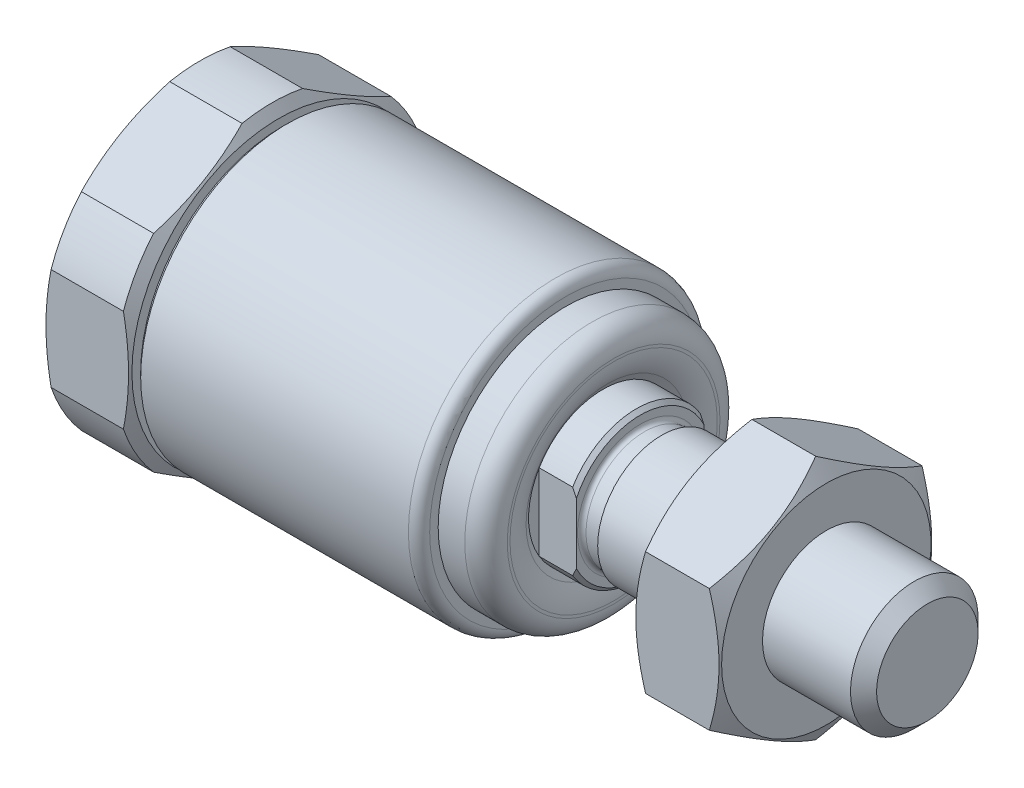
ISO-10303-21;
HEADER;
FILE_DESCRIPTION(('STEP AP214'),'2;1');
FILE_NAME('part.step','',(''),(''),'','','');
FILE_SCHEMA(('AUTOMOTIVE_DESIGN { 1 0 10303 214 1 1 1 1 }'));
ENDSEC;
DATA;
#1=APPLICATION_CONTEXT('core data for automotive mechanical design processes');
#2=APPLICATION_PROTOCOL_DEFINITION('international standard','automotive_design',2000,#1);
#3=PRODUCT_CONTEXT('',#1,'mechanical');
#4=PRODUCT('Part','Part','',(#3));
#5=PRODUCT_RELATED_PRODUCT_CATEGORY('part','',(#4));
#6=PRODUCT_DEFINITION_FORMATION('','',#4);
#7=PRODUCT_DEFINITION_CONTEXT('part definition',#1,'design');
#8=PRODUCT_DEFINITION('design','',#6,#7);
#9=PRODUCT_DEFINITION_SHAPE('','',#8);
#10=(LENGTH_UNIT() NAMED_UNIT(*) SI_UNIT(.MILLI.,.METRE.));
#11=(NAMED_UNIT(*) PLANE_ANGLE_UNIT() SI_UNIT($,.RADIAN.));
#12=(NAMED_UNIT(*) SI_UNIT($,.STERADIAN.) SOLID_ANGLE_UNIT());
#13=UNCERTAINTY_MEASURE_WITH_UNIT(LENGTH_MEASURE(1.E-05),#10,'distance_accuracy_value','');
#14=(GEOMETRIC_REPRESENTATION_CONTEXT(3) GLOBAL_UNCERTAINTY_ASSIGNED_CONTEXT((#13)) GLOBAL_UNIT_ASSIGNED_CONTEXT((#10,
#11,#12)) REPRESENTATION_CONTEXT('',''));
#15=CARTESIAN_POINT('',(0.,0.,0.));
#16=DIRECTION('',(0.,0.,1.));
#17=DIRECTION('',(1.,0.,0.));
#18=AXIS2_PLACEMENT_3D('',#15,#16,#17);
#19=CARTESIAN_POINT('',(34.5,0.,0.));
#20=DIRECTION('',(-1.,0.,0.));
#21=DIRECTION('',(0.,0.,1.));
#22=AXIS2_PLACEMENT_3D('',#19,#20,#21);
#23=CYLINDRICAL_SURFACE('',#22,7.4);
#24=CARTESIAN_POINT('',(3.7,0.,0.));
#25=DIRECTION('',(-1.,0.,0.));
#26=DIRECTION('',(0.,0.,1.));
#27=AXIS2_PLACEMENT_3D('',#24,#25,#26);
#28=CIRCLE('',#27,7.4);
#29=CARTESIAN_POINT('',(3.7,2.4,7.));
#30=VERTEX_POINT('',#29);
#31=CARTESIAN_POINT('',(3.7,4.86217782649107,5.57846096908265));
#32=VERTEX_POINT('',#31);
#33=EDGE_CURVE('E212',#30,#32,#28,.T.);
#34=ORIENTED_EDGE('',*,*,#33,.T.);
#35=DIRECTION('',(-1.,0.,0.));
#36=VECTOR('',#35,1.);
#37=CARTESIAN_POINT('',(34.5,4.86217782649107,5.57846096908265));
#38=LINE('',#37,#36);
#39=CARTESIAN_POINT('',(0.3,4.86217782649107,5.57846096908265));
#40=VERTEX_POINT('',#39);
#41=EDGE_CURVE('E544',#32,#40,#38,.T.);
#42=ORIENTED_EDGE('',*,*,#41,.T.);
#43=CARTESIAN_POINT('',(0.3,0.,0.));
#44=DIRECTION('',(-1.,0.,0.));
#45=DIRECTION('',(0.,0.,1.));
#46=AXIS2_PLACEMENT_3D('',#43,#44,#45);
#47=CIRCLE('',#46,7.4);
#48=CARTESIAN_POINT('',(0.3,2.4,7.));
#49=VERTEX_POINT('',#48);
#50=EDGE_CURVE('E222',#49,#40,#47,.T.);
#51=ORIENTED_EDGE('',*,*,#50,.F.);
#52=DIRECTION('',(-1.,0.,0.));
#53=VECTOR('',#52,1.);
#54=CARTESIAN_POINT('',(34.5,2.4,7.));
#55=LINE('',#54,#53);
#56=EDGE_CURVE('E537',#49,#30,#55,.F.);
#57=ORIENTED_EDGE('',*,*,#56,.T.);
#58=EDGE_LOOP('',(#34,#42,#51,#57));
#59=FACE_BOUND('',#58,.T.);
#60=ADVANCED_FACE('F16',(#59),#23,.T.);
#61=CARTESIAN_POINT('',(3.7,-4.86217782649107,5.57846096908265));
#62=VERTEX_POINT('',#61);
#63=CARTESIAN_POINT('',(3.7,-2.4,7.));
#64=VERTEX_POINT('',#63);
#65=EDGE_CURVE('E219',#62,#64,#28,.T.);
#66=ORIENTED_EDGE('',*,*,#65,.T.);
#67=DIRECTION('',(-1.,0.,0.));
#68=VECTOR('',#67,1.);
#69=CARTESIAN_POINT('',(34.5,-2.4,7.));
#70=LINE('',#69,#68);
#71=CARTESIAN_POINT('',(0.3,-2.4,7.));
#72=VERTEX_POINT('',#71);
#73=EDGE_CURVE('E37',#64,#72,#70,.T.);
#74=ORIENTED_EDGE('',*,*,#73,.T.);
#75=CARTESIAN_POINT('',(0.3,-4.86217782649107,5.57846096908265));
#76=VERTEX_POINT('',#75);
#77=EDGE_CURVE('E218',#76,#72,#47,.T.);
#78=ORIENTED_EDGE('',*,*,#77,.F.);
#79=DIRECTION('',(-1.,0.,0.));
#80=VECTOR('',#79,1.);
#81=CARTESIAN_POINT('',(34.5,-4.86217782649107,5.57846096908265));
#82=LINE('',#81,#80);
#83=EDGE_CURVE('E535',#76,#62,#82,.F.);
#84=ORIENTED_EDGE('',*,*,#83,.T.);
#85=EDGE_LOOP('',(#66,#74,#78,#84));
#86=FACE_BOUND('',#85,.T.);
#87=ADVANCED_FACE('F478',(#86),#23,.T.);
#88=CARTESIAN_POINT('',(3.7,-7.26217782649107,-1.42153903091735));
#89=VERTEX_POINT('',#88);
#90=CARTESIAN_POINT('',(3.7,-7.26217782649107,1.42153903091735));
#91=VERTEX_POINT('',#90);
#92=EDGE_CURVE('E214',#89,#91,#28,.T.);
#93=ORIENTED_EDGE('',*,*,#92,.T.);
#94=DIRECTION('',(-1.,0.,0.));
#95=VECTOR('',#94,1.);
#96=CARTESIAN_POINT('',(34.5,-7.26217782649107,1.42153903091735));
#97=LINE('',#96,#95);
#98=CARTESIAN_POINT('',(0.3,-7.26217782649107,1.42153903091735));
#99=VERTEX_POINT('',#98);
#100=EDGE_CURVE('E45',#91,#99,#97,.T.);
#101=ORIENTED_EDGE('',*,*,#100,.T.);
#102=CARTESIAN_POINT('',(0.3,-7.26217782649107,-1.42153903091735));
#103=VERTEX_POINT('',#102);
#104=EDGE_CURVE('E523',#103,#99,#47,.T.);
#105=ORIENTED_EDGE('',*,*,#104,.F.);
#106=DIRECTION('',(-1.,0.,0.));
#107=VECTOR('',#106,1.);
#108=CARTESIAN_POINT('',(34.5,-7.26217782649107,-1.42153903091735));
#109=LINE('',#108,#107);
#110=EDGE_CURVE('E519',#103,#89,#109,.F.);
#111=ORIENTED_EDGE('',*,*,#110,.T.);
#112=EDGE_LOOP('',(#93,#101,#105,#111));
#113=FACE_BOUND('',#112,.T.);
#114=ADVANCED_FACE('F484',(#113),#23,.T.);
#115=CARTESIAN_POINT('',(3.7000000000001,-2.40000000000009,-7.));
#116=VERTEX_POINT('',#115);
#117=CARTESIAN_POINT('',(3.7,-4.86217782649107,-5.57846096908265));
#118=VERTEX_POINT('',#117);
#119=EDGE_CURVE('E210',#116,#118,#28,.T.);
#120=ORIENTED_EDGE('',*,*,#119,.T.);
#121=DIRECTION('',(-1.,0.,0.));
#122=VECTOR('',#121,1.);
#123=CARTESIAN_POINT('',(34.5,-4.86217782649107,-5.57846096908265));
#124=LINE('',#123,#122);
#125=CARTESIAN_POINT('',(0.3,-4.86217782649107,-5.57846096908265));
#126=VERTEX_POINT('',#125);
#127=EDGE_CURVE('E514',#118,#126,#124,.T.);
#128=ORIENTED_EDGE('',*,*,#127,.T.);
#129=CARTESIAN_POINT('',(0.3,-2.4,-7.));
#130=VERTEX_POINT('',#129);
#131=EDGE_CURVE('E528',#130,#126,#47,.T.);
#132=ORIENTED_EDGE('',*,*,#131,.F.);
#133=DIRECTION('',(-1.,0.,0.));
#134=VECTOR('',#133,1.);
#135=CARTESIAN_POINT('',(34.5,-2.4,-7.));
#136=LINE('',#135,#134);
#137=EDGE_CURVE('E391',#130,#116,#136,.F.);
#138=ORIENTED_EDGE('',*,*,#137,.T.);
#139=EDGE_LOOP('',(#120,#128,#132,#138));
#140=FACE_BOUND('',#139,.T.);
#141=ADVANCED_FACE('F496',(#140),#23,.T.);
#142=CARTESIAN_POINT('',(3.7,4.86217782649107,-5.57846096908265));
#143=VERTEX_POINT('',#142);
#144=CARTESIAN_POINT('',(3.7,2.4,-7.));
#145=VERTEX_POINT('',#144);
#146=EDGE_CURVE('E201',#143,#145,#28,.T.);
#147=ORIENTED_EDGE('',*,*,#146,.T.);
#148=DIRECTION('',(-1.,0.,0.));
#149=VECTOR('',#148,1.);
#150=CARTESIAN_POINT('',(34.5,2.4,-7.));
#151=LINE('',#150,#149);
#152=CARTESIAN_POINT('',(0.3,2.4,-7.));
#153=VERTEX_POINT('',#152);
#154=EDGE_CURVE('E525',#145,#153,#151,.T.);
#155=ORIENTED_EDGE('',*,*,#154,.T.);
#156=CARTESIAN_POINT('',(0.3,4.86217782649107,-5.57846096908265));
#157=VERTEX_POINT('',#156);
#158=EDGE_CURVE('E203',#157,#153,#47,.T.);
#159=ORIENTED_EDGE('',*,*,#158,.F.);
#160=DIRECTION('',(-1.,0.,0.));
#161=VECTOR('',#160,1.);
#162=CARTESIAN_POINT('',(34.5,4.86217782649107,-5.57846096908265));
#163=LINE('',#162,#161);
#164=EDGE_CURVE('E185',#157,#143,#163,.F.);
#165=ORIENTED_EDGE('',*,*,#164,.T.);
#166=EDGE_LOOP('',(#147,#155,#159,#165));
#167=FACE_BOUND('',#166,.T.);
#168=ADVANCED_FACE('F199',(#167),#23,.T.);
#169=CARTESIAN_POINT('',(34.5,0.,0.));
#170=DIRECTION('',(-1.,0.,0.));
#171=DIRECTION('',(0.,0.,1.));
#172=AXIS2_PLACEMENT_3D('',#169,#170,#171);
#173=CYLINDRICAL_SURFACE('',#172,3.5);
#174=CARTESIAN_POINT('',(19.25,0.,0.));
#175=DIRECTION('',(-1.,0.,0.));
#176=DIRECTION('',(0.,0.,1.));
#177=AXIS2_PLACEMENT_3D('',#174,#175,#176);
#178=CIRCLE('',#177,3.5);
#179=CARTESIAN_POINT('',(19.25,1.802775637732,3.));
#180=VERTEX_POINT('',#179);
#181=CARTESIAN_POINT('',(19.25,1.802775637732,-3.));
#182=VERTEX_POINT('',#181);
#183=EDGE_CURVE('E552',#180,#182,#178,.T.);
#184=ORIENTED_EDGE('',*,*,#183,.F.);
#185=DIRECTION('',(1.,0.,0.));
#186=VECTOR('',#185,1.);
#187=CARTESIAN_POINT('',(19.25,1.802775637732,3.));
#188=LINE('',#187,#186);
#189=CARTESIAN_POINT('',(20.8232233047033,1.802775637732,3.));
#190=VERTEX_POINT('',#189);
#191=EDGE_CURVE('E576',#180,#190,#188,.T.);
#192=ORIENTED_EDGE('',*,*,#191,.T.);
#193=CARTESIAN_POINT('',(20.8232233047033,0.,0.));
#194=DIRECTION('',(-1.,0.,0.));
#195=DIRECTION('',(0.,0.,1.));
#196=AXIS2_PLACEMENT_3D('',#193,#194,#195);
#197=CIRCLE('',#196,3.5);
#198=CARTESIAN_POINT('',(20.8232233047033,1.802775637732,-3.));
#199=VERTEX_POINT('',#198);
#200=EDGE_CURVE('E650',#190,#199,#197,.T.);
#201=ORIENTED_EDGE('',*,*,#200,.T.);
#202=DIRECTION('',(1.,0.,0.));
#203=VECTOR('',#202,1.);
#204=CARTESIAN_POINT('',(19.25,1.802775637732,-3.));
#205=LINE('',#204,#203);
#206=EDGE_CURVE('E579',#182,#199,#205,.T.);
#207=ORIENTED_EDGE('',*,*,#206,.F.);
#208=EDGE_LOOP('',(#184,#192,#201,#207));
#209=FACE_BOUND('',#208,.T.);
#210=ADVANCED_FACE('F495',(#209),#173,.T.);
#211=CARTESIAN_POINT('',(19.25,-1.802775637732,-3.));
#212=VERTEX_POINT('',#211);
#213=CARTESIAN_POINT('',(19.25,-1.802775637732,3.));
#214=VERTEX_POINT('',#213);
#215=EDGE_CURVE('E546',#212,#214,#178,.T.);
#216=ORIENTED_EDGE('',*,*,#215,.F.);
#217=DIRECTION('',(1.,0.,0.));
#218=VECTOR('',#217,1.);
#219=CARTESIAN_POINT('',(19.25,-1.802775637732,-3.));
#220=LINE('',#219,#218);
#221=CARTESIAN_POINT('',(20.8232233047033,-1.802775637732,-3.));
#222=VERTEX_POINT('',#221);
#223=EDGE_CURVE('E572',#212,#222,#220,.T.);
#224=ORIENTED_EDGE('',*,*,#223,.T.);
#225=CARTESIAN_POINT('',(20.8232233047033,-1.802775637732,3.));
#226=VERTEX_POINT('',#225);
#227=EDGE_CURVE('E654',#222,#226,#197,.T.);
#228=ORIENTED_EDGE('',*,*,#227,.T.);
#229=DIRECTION('',(1.,0.,0.));
#230=VECTOR('',#229,1.);
#231=CARTESIAN_POINT('',(19.25,-1.802775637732,3.));
#232=LINE('',#231,#230);
#233=EDGE_CURVE('E573',#214,#226,#232,.T.);
#234=ORIENTED_EDGE('',*,*,#233,.F.);
#235=EDGE_LOOP('',(#216,#224,#228,#234));
#236=FACE_BOUND('',#235,.T.);
#237=ADVANCED_FACE('F502',(#236),#173,.T.);
#238=CARTESIAN_POINT('',(21.,0.,0.));
#239=DIRECTION('',(-1.,0.,0.));
#240=DIRECTION('',(0.,0.,1.));
#241=AXIS2_PLACEMENT_3D('',#238,#239,#240);
#242=CONICAL_SURFACE('',#241,3.32322330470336,0.785398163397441);
#243=CARTESIAN_POINT('',(19.3480643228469,-3.96890499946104,3.));
#244=CARTESIAN_POINT('',(19.4155355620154,-3.88431474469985,3.));
#245=CARTESIAN_POINT('',(19.4825414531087,-3.79934913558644,3.));
#246=CARTESIAN_POINT('',(19.6154309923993,-3.62852800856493,3.));
#247=CARTESIAN_POINT('',(19.6813144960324,-3.54267237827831,3.));
#248=CARTESIAN_POINT('',(19.8119932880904,-3.36963189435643,3.));
#249=CARTESIAN_POINT('',(19.8767836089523,-3.28244328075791,3.));
#250=CARTESIAN_POINT('',(20.0047535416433,-3.10689454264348,3.));
#251=CARTESIAN_POINT('',(20.0679332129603,-3.01853446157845,3.));
#252=CARTESIAN_POINT('',(20.1947038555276,-2.83708406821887,3.));
#253=CARTESIAN_POINT('',(20.2582199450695,-2.74394127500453,3.));
#254=CARTESIAN_POINT('',(20.3826749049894,-2.55595107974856,3.));
#255=CARTESIAN_POINT('',(20.4436139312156,-2.46110378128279,3.));
#256=CARTESIAN_POINT('',(20.5622107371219,-2.26955195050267,3.));
#257=CARTESIAN_POINT('',(20.6198729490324,-2.17285017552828,3.));
#258=CARTESIAN_POINT('',(20.7311858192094,-1.97717196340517,3.));
#259=CARTESIAN_POINT('',(20.7848372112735,-1.87819594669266,3.));
#260=CARTESIAN_POINT('',(20.8834935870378,-1.68468733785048,3.));
#261=CARTESIAN_POINT('',(20.9288411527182,-1.59033057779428,3.));
#262=CARTESIAN_POINT('',(21.0140986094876,-1.39915166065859,3.));
#263=CARTESIAN_POINT('',(21.0540077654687,-1.30232917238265,3.));
#264=CARTESIAN_POINT('',(21.1268071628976,-1.10690174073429,3.));
#265=CARTESIAN_POINT('',(21.1597491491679,-1.00831629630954,3.));
#266=CARTESIAN_POINT('',(21.2175687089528,-0.80881752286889,3.));
#267=CARTESIAN_POINT('',(21.2424501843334,-0.707905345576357,3.));
#268=CARTESIAN_POINT('',(21.2797282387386,-0.519649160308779,3.));
#269=CARTESIAN_POINT('',(21.2934459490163,-0.432568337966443,3.));
#270=CARTESIAN_POINT('',(21.3134419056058,-0.25755480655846,3.));
#271=CARTESIAN_POINT('',(21.3197212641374,-0.169622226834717,3.));
#272=CARTESIAN_POINT('',(21.3245048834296,0.00637237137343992,3.));
#273=CARTESIAN_POINT('',(21.3230166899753,0.0944341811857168,3.));
#274=CARTESIAN_POINT('',(21.3123667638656,0.270093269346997,3.));
#275=CARTESIAN_POINT('',(21.3032039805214,0.357690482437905,3.));
#276=CARTESIAN_POINT('',(21.2743507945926,0.554418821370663,3.));
#277=CARTESIAN_POINT('',(21.2525457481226,0.663240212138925,3.));
#278=CARTESIAN_POINT('',(21.1990102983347,0.87840472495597,3.));
#279=CARTESIAN_POINT('',(21.1672754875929,0.984746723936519,3.));
#280=CARTESIAN_POINT('',(21.0952210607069,1.1958082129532,3.));
#281=CARTESIAN_POINT('',(21.0548068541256,1.30049494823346,3.));
#282=CARTESIAN_POINT('',(20.9672963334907,1.5069818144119,3.));
#283=CARTESIAN_POINT('',(20.9202010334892,1.60878238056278,3.));
#284=CARTESIAN_POINT('',(20.8188213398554,1.81357364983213,3.));
#285=CARTESIAN_POINT('',(20.7643312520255,1.91646164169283,3.));
#286=CARTESIAN_POINT('',(20.6508647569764,2.11974762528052,3.));
#287=CARTESIAN_POINT('',(20.5918872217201,2.22014498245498,3.));
#288=CARTESIAN_POINT('',(20.4703034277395,2.41892156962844,3.));
#289=CARTESIAN_POINT('',(20.4076916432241,2.51729740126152,3.));
#290=CARTESIAN_POINT('',(20.2796375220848,2.71219114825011,3.));
#291=CARTESIAN_POINT('',(20.2141949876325,2.8087089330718,3.));
#292=CARTESIAN_POINT('',(20.0841152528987,2.99571965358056,3.));
#293=CARTESIAN_POINT('',(20.0195811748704,3.08628456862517,3.));
#294=CARTESIAN_POINT('',(19.8888029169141,3.26617452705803,3.));
#295=CARTESIAN_POINT('',(19.8225586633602,3.35549951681,3.));
#296=CARTESIAN_POINT('',(19.6889383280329,3.53270086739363,3.));
#297=CARTESIAN_POINT('',(19.6215682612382,3.62058177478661,3.));
#298=CARTESIAN_POINT('',(19.485648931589,3.79540756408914,3.));
#299=CARTESIAN_POINT('',(19.4170998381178,3.88235257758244,3.));
#300=CARTESIAN_POINT('',(19.3480643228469,3.96890499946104,3.));
#301=B_SPLINE_CURVE_WITH_KNOTS('',3,(#243,#244,#245,#246,#247,#248,#249,#250,#251,#252,#253,
#254,#255,#256,#257,#258,#259,#260,#261,#262,#263,#264,#265,#266,#267,#268,#269,#270,#271,#272,
#273,#274,#275,#276,#277,#278,#279,#280,#281,#282,#283,#284,#285,#286,#287,#288,#289,#290,#291,
#292,#293,#294,#295,#296,#297,#298,#299,#300),.UNSPECIFIED.,.F.,.F.,(4,2,2,2,2,2,2,2,2,2,2,2,2,
2,2,2,2,2,2,2,2,2,2,2,2,2,2,2,4),(0.,0.324612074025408,0.649265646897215,0.975128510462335,
1.30097932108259,1.63915887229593,1.97731794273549,2.31500816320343,2.65263644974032,
2.96656313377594,3.28053220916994,3.59208051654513,3.90347778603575,4.16765077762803,
4.43178426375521,4.69566120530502,4.95957427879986,5.29196140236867,5.62449626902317,
5.96085791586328,6.2971685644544,6.64630701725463,6.99553352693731,7.34530569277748,
7.69510234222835,8.0286953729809,8.36230278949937,8.69449076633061,9.02663141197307),.UNSPECIFIED.);
#302=CARTESIAN_POINT('',(21.,-1.42961992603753,3.));
#303=VERTEX_POINT('',#302);
#304=EDGE_CURVE('E1273',#226,#303,#301,.T.);
#305=ORIENTED_EDGE('',*,*,#304,.F.);
#306=ORIENTED_EDGE('',*,*,#227,.F.);
#307=CARTESIAN_POINT('',(19.3480643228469,3.96890499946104,-3.));
#308=CARTESIAN_POINT('',(19.4155355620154,3.88431474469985,-3.));
#309=CARTESIAN_POINT('',(19.4825414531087,3.79934913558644,-3.));
#310=CARTESIAN_POINT('',(19.6154309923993,3.62852800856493,-3.));
#311=CARTESIAN_POINT('',(19.6813144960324,3.54267237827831,-3.));
#312=CARTESIAN_POINT('',(19.8119932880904,3.36963189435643,-3.));
#313=CARTESIAN_POINT('',(19.8767836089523,3.28244328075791,-3.));
#314=CARTESIAN_POINT('',(20.0047535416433,3.10689454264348,-3.));
#315=CARTESIAN_POINT('',(20.0679332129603,3.01853446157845,-3.));
#316=CARTESIAN_POINT('',(20.1947038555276,2.83708406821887,-3.));
#317=CARTESIAN_POINT('',(20.2582199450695,2.74394127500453,-3.));
#318=CARTESIAN_POINT('',(20.3826749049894,2.55595107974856,-3.));
#319=CARTESIAN_POINT('',(20.4436139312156,2.46110378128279,-3.));
#320=CARTESIAN_POINT('',(20.5622107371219,2.26955195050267,-3.));
#321=CARTESIAN_POINT('',(20.6198729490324,2.17285017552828,-3.));
#322=CARTESIAN_POINT('',(20.7311858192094,1.97717196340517,-3.));
#323=CARTESIAN_POINT('',(20.7848372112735,1.87819594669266,-3.));
#324=CARTESIAN_POINT('',(20.8834935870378,1.68468733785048,-3.));
#325=CARTESIAN_POINT('',(20.9288411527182,1.59033057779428,-3.));
#326=CARTESIAN_POINT('',(21.0140986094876,1.39915166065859,-3.));
#327=CARTESIAN_POINT('',(21.0540077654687,1.30232917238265,-3.));
#328=CARTESIAN_POINT('',(21.1268071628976,1.10690174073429,-3.));
#329=CARTESIAN_POINT('',(21.1597491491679,1.00831629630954,-3.));
#330=CARTESIAN_POINT('',(21.2175687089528,0.80881752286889,-3.));
#331=CARTESIAN_POINT('',(21.2424501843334,0.707905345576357,-3.));
#332=CARTESIAN_POINT('',(21.2797282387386,0.519649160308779,-3.));
#333=CARTESIAN_POINT('',(21.2934459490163,0.432568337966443,-3.));
#334=CARTESIAN_POINT('',(21.3134419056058,0.25755480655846,-3.));
#335=CARTESIAN_POINT('',(21.3197212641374,0.169622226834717,-3.));
#336=CARTESIAN_POINT('',(21.3245048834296,-0.00637237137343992,-3.));
#337=CARTESIAN_POINT('',(21.3230166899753,-0.0944341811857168,-3.));
#338=CARTESIAN_POINT('',(21.3123667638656,-0.270093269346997,-3.));
#339=CARTESIAN_POINT('',(21.3032039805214,-0.357690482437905,-3.));
#340=CARTESIAN_POINT('',(21.2743507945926,-0.554418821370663,-3.));
#341=CARTESIAN_POINT('',(21.2525457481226,-0.663240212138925,-3.));
#342=CARTESIAN_POINT('',(21.1990102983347,-0.87840472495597,-3.));
#343=CARTESIAN_POINT('',(21.1672754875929,-0.984746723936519,-3.));
#344=CARTESIAN_POINT('',(21.0952210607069,-1.1958082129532,-3.));
#345=CARTESIAN_POINT('',(21.0548068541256,-1.30049494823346,-3.));
#346=CARTESIAN_POINT('',(20.9672963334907,-1.5069818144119,-3.));
#347=CARTESIAN_POINT('',(20.9202010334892,-1.60878238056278,-3.));
#348=CARTESIAN_POINT('',(20.8188213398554,-1.81357364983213,-3.));
#349=CARTESIAN_POINT('',(20.7643312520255,-1.91646164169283,-3.));
#350=CARTESIAN_POINT('',(20.6508647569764,-2.11974762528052,-3.));
#351=CARTESIAN_POINT('',(20.5918872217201,-2.22014498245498,-3.));
#352=CARTESIAN_POINT('',(20.4703034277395,-2.41892156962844,-3.));
#353=CARTESIAN_POINT('',(20.4076916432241,-2.51729740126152,-3.));
#354=CARTESIAN_POINT('',(20.2796375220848,-2.71219114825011,-3.));
#355=CARTESIAN_POINT('',(20.2141949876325,-2.8087089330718,-3.));
#356=CARTESIAN_POINT('',(20.0841152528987,-2.99571965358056,-3.));
#357=CARTESIAN_POINT('',(20.0195811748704,-3.08628456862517,-3.));
#358=CARTESIAN_POINT('',(19.8888029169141,-3.26617452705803,-3.));
#359=CARTESIAN_POINT('',(19.8225586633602,-3.35549951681,-3.));
#360=CARTESIAN_POINT('',(19.6889383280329,-3.53270086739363,-3.));
#361=CARTESIAN_POINT('',(19.6215682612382,-3.62058177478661,-3.));
#362=CARTESIAN_POINT('',(19.485648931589,-3.79540756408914,-3.));
#363=CARTESIAN_POINT('',(19.4170998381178,-3.88235257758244,-3.));
#364=CARTESIAN_POINT('',(19.3480643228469,-3.96890499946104,-3.));
#365=B_SPLINE_CURVE_WITH_KNOTS('',3,(#307,#308,#309,#310,#311,#312,#313,#314,#315,#316,#317,
#318,#319,#320,#321,#322,#323,#324,#325,#326,#327,#328,#329,#330,#331,#332,#333,#334,#335,#336,
#337,#338,#339,#340,#341,#342,#343,#344,#345,#346,#347,#348,#349,#350,#351,#352,#353,#354,#355,
#356,#357,#358,#359,#360,#361,#362,#363,#364),.UNSPECIFIED.,.F.,.F.,(4,2,2,2,2,2,2,2,2,2,2,2,2,
2,2,2,2,2,2,2,2,2,2,2,2,2,2,2,4),(0.,0.324612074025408,0.649265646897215,0.975128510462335,
1.30097932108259,1.63915887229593,1.97731794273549,2.31500816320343,2.65263644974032,
2.96656313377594,3.28053220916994,3.59208051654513,3.90347778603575,4.16765077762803,
4.43178426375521,4.69566120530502,4.95957427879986,5.29196140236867,5.62449626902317,
5.96085791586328,6.2971685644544,6.64630701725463,6.99553352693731,7.34530569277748,
7.69510234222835,8.0286953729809,8.36230278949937,8.69449076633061,9.02663141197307),.UNSPECIFIED.);
#366=CARTESIAN_POINT('',(21.,-1.42961992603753,-3.));
#367=VERTEX_POINT('',#366);
#368=EDGE_CURVE('E575',#367,#222,#365,.T.);
#369=ORIENTED_EDGE('',*,*,#368,.F.);
#370=CARTESIAN_POINT('',(21.,0.,0.));
#371=DIRECTION('',(-1.,0.,0.));
#372=DIRECTION('',(0.,0.,1.));
#373=AXIS2_PLACEMENT_3D('',#370,#371,#372);
#374=CIRCLE('',#373,3.32322330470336);
#375=EDGE_CURVE('E1283',#367,#303,#374,.T.);
#376=ORIENTED_EDGE('',*,*,#375,.T.);
#377=EDGE_LOOP('',(#305,#306,#369,#376));
#378=FACE_BOUND('',#377,.T.);
#379=ADVANCED_FACE('F597',(#378),#242,.T.);
#380=CARTESIAN_POINT('',(21.,1.42961992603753,3.));
#381=VERTEX_POINT('',#380);
#382=EDGE_CURVE('E590',#381,#190,#301,.T.);
#383=ORIENTED_EDGE('',*,*,#382,.F.);
#384=CARTESIAN_POINT('',(21.,1.42961992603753,-3.));
#385=VERTEX_POINT('',#384);
#386=EDGE_CURVE('E660',#381,#385,#374,.T.);
#387=ORIENTED_EDGE('',*,*,#386,.T.);
#388=EDGE_CURVE('E589',#199,#385,#365,.T.);
#389=ORIENTED_EDGE('',*,*,#388,.F.);
#390=ORIENTED_EDGE('',*,*,#200,.F.);
#391=EDGE_LOOP('',(#383,#387,#389,#390));
#392=FACE_BOUND('',#391,.T.);
#393=ADVANCED_FACE('F821',(#392),#242,.T.);
#394=CARTESIAN_POINT('',(21.,3.32322330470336,0.));
#395=DIRECTION('',(-1.,0.,0.));
#396=DIRECTION('',(0.,0.,1.));
#397=AXIS2_PLACEMENT_3D('',#394,#395,#396);
#398=PLANE('',#397);
#399=CARTESIAN_POINT('',(21.,0.,0.));
#400=DIRECTION('',(-1.,0.,0.));
#401=DIRECTION('',(0.,0.,1.));
#402=AXIS2_PLACEMENT_3D('',#399,#400,#401);
#403=CIRCLE('',#402,2.95);
#404=CARTESIAN_POINT('',(21.,0.,2.95));
#405=VERTEX_POINT('',#404);
#406=EDGE_CURVE('E1284',#405,#405,#403,.T.);
#407=ORIENTED_EDGE('',*,*,#406,.T.);
#408=EDGE_LOOP('',(#407));
#409=FACE_BOUND('',#408,.T.);
#410=DIRECTION('',(0.,1.,0.));
#411=VECTOR('',#410,1.);
#412=CARTESIAN_POINT('',(21.,3.32322330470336,3.));
#413=LINE('',#412,#411);
#414=EDGE_CURVE('E354',#303,#381,#413,.T.);
#415=ORIENTED_EDGE('',*,*,#414,.F.);
#416=ORIENTED_EDGE('',*,*,#375,.F.);
#417=DIRECTION('',(0.,-1.,0.));
#418=VECTOR('',#417,1.);
#419=CARTESIAN_POINT('',(21.,3.32322330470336,-3.));
#420=LINE('',#419,#418);
#421=EDGE_CURVE('E352',#385,#367,#420,.T.);
#422=ORIENTED_EDGE('',*,*,#421,.F.);
#423=ORIENTED_EDGE('',*,*,#386,.F.);
#424=EDGE_LOOP('',(#415,#416,#422,#423));
#425=FACE_BOUND('',#424,.T.);
#426=ADVANCED_FACE('F288',(#409,#425),#398,.F.);
#427=CARTESIAN_POINT('',(26.25,0.,0.));
#428=DIRECTION('',(1.,0.,0.));
#429=DIRECTION('',(0.,0.,-1.));
#430=AXIS2_PLACEMENT_3D('',#427,#428,#429);
#431=CONICAL_SURFACE('',#430,5.77350269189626,1.03907225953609);
#432=CARTESIAN_POINT('',(25.75,0.,0.));
#433=DIRECTION('',(-1.,0.,0.));
#434=DIRECTION('',(0.,0.,1.));
#435=AXIS2_PLACEMENT_3D('',#432,#433,#434);
#436=CIRCLE('',#435,4.92350269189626);
#437=CARTESIAN_POINT('',(25.75,0.,4.92350269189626));
#438=VERTEX_POINT('',#437);
#439=EDGE_CURVE('E1312',#438,#438,#436,.T.);
#440=ORIENTED_EDGE('',*,*,#439,.F.);
#441=EDGE_LOOP('',(#440));
#442=FACE_BOUND('',#441,.T.);
#443=CARTESIAN_POINT('',(26.2500679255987,5.7736181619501,-0.0002));
#444=CARTESIAN_POINT('',(26.1752899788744,5.64656940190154,0.219854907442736));
#445=CARTESIAN_POINT('',(26.1072772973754,5.51835174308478,0.441934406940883));
#446=CARTESIAN_POINT('',(25.9885779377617,5.25960827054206,0.89009124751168));
#447=CARTESIAN_POINT('',(25.9379352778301,5.12907746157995,1.11617724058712));
#448=CARTESIAN_POINT('',(25.8786316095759,4.93372498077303,1.45453766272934));
#449=CARTESIAN_POINT('',(25.8617587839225,4.86952696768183,1.56573188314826));
#450=CARTESIAN_POINT('',(25.8334965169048,4.74083327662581,1.78863589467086));
#451=CARTESIAN_POINT('',(25.8221065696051,4.67633762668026,1.90034563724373));
#452=CARTESIAN_POINT('',(25.8051047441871,4.5472313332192,2.12396429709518));
#453=CARTESIAN_POINT('',(25.7994859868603,4.48262091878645,2.2358728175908));
#454=CARTESIAN_POINT('',(25.7941419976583,4.35334399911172,2.45978701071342));
#455=CARTESIAN_POINT('',(25.794416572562,4.28867749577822,2.57179268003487));
#456=CARTESIAN_POINT('',(25.8032404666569,4.11202937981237,2.87775619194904));
#457=CARTESIAN_POINT('',(25.8177075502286,4.00010980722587,3.07160657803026));
#458=CARTESIAN_POINT('',(25.863333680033,3.7770438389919,3.45796816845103));
#459=CARTESIAN_POINT('',(25.8945088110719,3.66589829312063,3.65047790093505));
#460=CARTESIAN_POINT('',(25.9723429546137,3.44237247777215,4.03763596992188));
#461=CARTESIAN_POINT('',(26.0193409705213,3.33002243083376,4.23223195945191));
#462=CARTESIAN_POINT('',(26.1259207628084,3.10705544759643,4.61842210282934));
#463=CARTESIAN_POINT('',(26.1854766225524,2.99643543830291,4.81002157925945));
#464=CARTESIAN_POINT('',(26.2500679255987,2.88663587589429,5.0002));
#465=B_SPLINE_CURVE_WITH_KNOTS('',3,(#443,#444,#445,#446,#447,#448,#449,#450,#451,#452,#453,
#454,#455,#456,#457,#458,#459,#460,#461,#462,#463,#464),.UNSPECIFIED.,.F.,.F.,(4,2,2,2,2,2,2,2,
2,2,4),(0.,0.795057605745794,1.5921153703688,1.98050715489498,2.36886309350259,2.75675557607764,
3.14463534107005,3.81682618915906,4.48966531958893,5.17794938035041,5.86482663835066),.UNSPECIFIED.);
#466=CARTESIAN_POINT('',(26.25,5.77350269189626,0.));
#467=VERTEX_POINT('',#466);
#468=CARTESIAN_POINT('',(26.25,2.88675134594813,5.));
#469=VERTEX_POINT('',#468);
#470=EDGE_CURVE('E317',#467,#469,#465,.T.);
#471=ORIENTED_EDGE('',*,*,#470,.F.);
#472=CARTESIAN_POINT('',(26.2500679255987,2.88663587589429,-5.0002));
#473=CARTESIAN_POINT('',(26.1752899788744,3.01368463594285,-4.78014509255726));
#474=CARTESIAN_POINT('',(26.1072772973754,3.14190229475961,-4.55806559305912));
#475=CARTESIAN_POINT('',(25.9885779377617,3.40064576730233,-4.10990875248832));
#476=CARTESIAN_POINT('',(25.9379352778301,3.53117657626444,-3.88382275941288));
#477=CARTESIAN_POINT('',(25.8786316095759,3.72652905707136,-3.54546233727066));
#478=CARTESIAN_POINT('',(25.8617587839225,3.79072707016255,-3.43426811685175));
#479=CARTESIAN_POINT('',(25.8334965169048,3.91942076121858,-3.21136410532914));
#480=CARTESIAN_POINT('',(25.8221065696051,3.98391641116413,-3.09965436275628));
#481=CARTESIAN_POINT('',(25.8051047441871,4.11302270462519,-2.87603570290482));
#482=CARTESIAN_POINT('',(25.7994859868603,4.17763311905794,-2.7641271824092));
#483=CARTESIAN_POINT('',(25.7941419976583,4.30691003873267,-2.54021298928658));
#484=CARTESIAN_POINT('',(25.794416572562,4.37157654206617,-2.42820731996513));
#485=CARTESIAN_POINT('',(25.8032404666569,4.54822465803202,-2.12224380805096));
#486=CARTESIAN_POINT('',(25.8177075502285,4.66014423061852,-1.92839342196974));
#487=CARTESIAN_POINT('',(25.863333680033,4.88321019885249,-1.54203183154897));
#488=CARTESIAN_POINT('',(25.8945088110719,4.99435574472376,-1.34952209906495));
#489=CARTESIAN_POINT('',(25.9723429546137,5.21788156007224,-0.962364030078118));
#490=CARTESIAN_POINT('',(26.0193409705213,5.33023160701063,-0.767768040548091));
#491=CARTESIAN_POINT('',(26.1259207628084,5.55319859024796,-0.381577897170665));
#492=CARTESIAN_POINT('',(26.1854766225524,5.66381859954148,-0.189978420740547));
#493=CARTESIAN_POINT('',(26.2500679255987,5.7736181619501,0.000199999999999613));
#494=B_SPLINE_CURVE_WITH_KNOTS('',3,(#472,#473,#474,#475,#476,#477,#478,#479,#480,#481,#482,
#483,#484,#485,#486,#487,#488,#489,#490,#491,#492,#493),.UNSPECIFIED.,.F.,.F.,(4,2,2,2,2,2,2,2,
2,2,4),(0.,0.795057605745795,1.5921153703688,1.98050715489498,2.36886309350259,2.75675557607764,
3.14463534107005,3.81682618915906,4.48966531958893,5.17794938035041,5.86482663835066),.UNSPECIFIED.);
#495=CARTESIAN_POINT('',(26.25,2.88675134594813,-5.));
#496=VERTEX_POINT('',#495);
#497=EDGE_CURVE('E311',#496,#467,#494,.T.);
#498=ORIENTED_EDGE('',*,*,#497,.F.);
#499=CARTESIAN_POINT('',(28.2295574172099,-7.64962463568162,-5.));
#500=CARTESIAN_POINT('',(28.1216954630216,-7.43050045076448,-5.));
#501=CARTESIAN_POINT('',(28.0148980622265,-7.21084257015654,-5.));
#502=CARTESIAN_POINT('',(27.8040419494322,-6.77017004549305,-5.));
#503=CARTESIAN_POINT('',(27.6999837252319,-6.5491551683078,-5.));
#504=CARTESIAN_POINT('',(27.4946468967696,-6.10424085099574,-5.));
#505=CARTESIAN_POINT('',(27.3933884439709,-5.88033207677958,-5.));
#506=CARTESIAN_POINT('',(27.195196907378,-5.43061572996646,-5.));
#507=CARTESIAN_POINT('',(27.0982635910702,-5.20480826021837,-5.));
#508=CARTESIAN_POINT('',(26.9086506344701,-4.74793514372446,-5.));
#509=CARTESIAN_POINT('',(26.816043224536,-4.51683935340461,-5.));
#510=CARTESIAN_POINT('',(26.6380600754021,-4.05182801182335,-5.));
#511=CARTESIAN_POINT('',(26.5526851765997,-3.81791213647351,-5.));
#512=CARTESIAN_POINT('',(26.3914781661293,-3.34736859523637,-5.));
#513=CARTESIAN_POINT('',(26.3156250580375,-3.11074819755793,-5.));
#514=CARTESIAN_POINT('',(26.1759394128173,-2.63402000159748,-5.));
#515=CARTESIAN_POINT('',(26.1121029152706,-2.39391338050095,-5.));
#516=CARTESIAN_POINT('',(25.999582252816,-1.91003156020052,-5.));
#517=CARTESIAN_POINT('',(25.9509026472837,-1.66625528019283,-5.));
#518=CARTESIAN_POINT('',(25.8720256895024,-1.17565853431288,-5.));
#519=CARTESIAN_POINT('',(25.8418280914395,-0.928838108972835,-5.));
#520=CARTESIAN_POINT('',(25.8026358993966,-0.435148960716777,-5.));
#521=CARTESIAN_POINT('',(25.7934998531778,-0.188291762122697,-5.));
#522=CARTESIAN_POINT('',(25.796899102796,0.305221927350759,-5.));
#523=CARTESIAN_POINT('',(25.8094290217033,0.551878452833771,-5.));
#524=CARTESIAN_POINT('',(25.8480536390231,0.968954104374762,-5.));
#525=CARTESIAN_POINT('',(25.8689049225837,1.13988683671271,-5.));
#526=CARTESIAN_POINT('',(25.9196795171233,1.48040926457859,-5.));
#527=CARTESIAN_POINT('',(25.9496041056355,1.6499987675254,-5.));
#528=CARTESIAN_POINT('',(26.0515479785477,2.15700307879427,-5.));
#529=CARTESIAN_POINT('',(26.1356703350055,2.49200839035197,-5.));
#530=CARTESIAN_POINT('',(26.2806060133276,2.99310299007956,-5.));
#531=CARTESIAN_POINT('',(26.3327606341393,3.16184305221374,-5.));
#532=CARTESIAN_POINT('',(26.4422563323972,3.49766388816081,-5.));
#533=CARTESIAN_POINT('',(26.4995978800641,3.66474451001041,-5.));
#534=CARTESIAN_POINT('',(26.6182592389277,3.99642653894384,-5.));
#535=CARTESIAN_POINT('',(26.6795552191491,4.16103655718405,-5.));
#536=CARTESIAN_POINT('',(26.8057087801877,4.48882312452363,-5.));
#537=CARTESIAN_POINT('',(26.8705651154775,4.65200015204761,-5.));
#538=CARTESIAN_POINT('',(26.9368737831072,4.81457085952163,-5.));
#539=B_SPLINE_CURVE_WITH_KNOTS('',3,(#499,#500,#501,#502,#503,#504,#505,#506,#507,#508,#509,
#510,#511,#512,#513,#514,#515,#516,#517,#518,#519,#520,#521,#522,#523,#524,#525,#526,#527,#528,
#529,#530,#531,#532,#533,#534,#535,#536,#537,#538),.UNSPECIFIED.,.F.,.F.,(4,2,2,2,2,2,2,2,2,2,2,
2,2,2,2,2,2,2,2,4),(0.,0.732708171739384,1.46554595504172,2.20273113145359,2.93987662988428,
3.68666489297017,4.43353981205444,5.17873773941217,5.92368963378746,6.66886540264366,
7.41403126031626,8.15417771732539,8.89414051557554,9.41049195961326,9.92691614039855,
10.9617021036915,11.4915076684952,12.0213613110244,12.5482759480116,13.0750074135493),.UNSPECIFIED.);
#540=CARTESIAN_POINT('',(26.25,-2.88675134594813,-5.));
#541=VERTEX_POINT('',#540);
#542=EDGE_CURVE('E304',#541,#496,#539,.T.);
#543=ORIENTED_EDGE('',*,*,#542,.F.);
#544=CARTESIAN_POINT('',(26.2500679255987,-5.7736181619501,0.0002));
#545=CARTESIAN_POINT('',(26.1752899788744,-5.64656940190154,-0.219854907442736));
#546=CARTESIAN_POINT('',(26.1072772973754,-5.51835174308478,-0.441934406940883));
#547=CARTESIAN_POINT('',(25.9885779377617,-5.25960827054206,-0.89009124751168));
#548=CARTESIAN_POINT('',(25.9379352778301,-5.12907746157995,-1.11617724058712));
#549=CARTESIAN_POINT('',(25.8786316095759,-4.93372498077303,-1.45453766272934));
#550=CARTESIAN_POINT('',(25.8617587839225,-4.86952696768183,-1.56573188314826));
#551=CARTESIAN_POINT('',(25.8334965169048,-4.74083327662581,-1.78863589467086));
#552=CARTESIAN_POINT('',(25.8221065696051,-4.67633762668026,-1.90034563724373));
#553=CARTESIAN_POINT('',(25.8051047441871,-4.5472313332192,-2.12396429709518));
#554=CARTESIAN_POINT('',(25.7994859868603,-4.48262091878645,-2.2358728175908));
#555=CARTESIAN_POINT('',(25.7941419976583,-4.35334399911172,-2.45978701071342));
#556=CARTESIAN_POINT('',(25.794416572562,-4.28867749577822,-2.57179268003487));
#557=CARTESIAN_POINT('',(25.8032404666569,-4.11202937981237,-2.87775619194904));
#558=CARTESIAN_POINT('',(25.8177075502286,-4.00010980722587,-3.07160657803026));
#559=CARTESIAN_POINT('',(25.863333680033,-3.7770438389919,-3.45796816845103));
#560=CARTESIAN_POINT('',(25.8945088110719,-3.66589829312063,-3.65047790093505));
#561=CARTESIAN_POINT('',(25.9723429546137,-3.44237247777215,-4.03763596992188));
#562=CARTESIAN_POINT('',(26.0193409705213,-3.33002243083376,-4.23223195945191));
#563=CARTESIAN_POINT('',(26.1259207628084,-3.10705544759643,-4.61842210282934));
#564=CARTESIAN_POINT('',(26.1854766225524,-2.99643543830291,-4.81002157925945));
#565=CARTESIAN_POINT('',(26.2500679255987,-2.88663587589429,-5.0002));
#566=B_SPLINE_CURVE_WITH_KNOTS('',3,(#544,#545,#546,#547,#548,#549,#550,#551,#552,#553,#554,
#555,#556,#557,#558,#559,#560,#561,#562,#563,#564,#565),.UNSPECIFIED.,.F.,.F.,(4,2,2,2,2,2,2,2,
2,2,4),(0.,0.795057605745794,1.5921153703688,1.98050715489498,2.36886309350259,2.75675557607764,
3.14463534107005,3.81682618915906,4.48966531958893,5.17794938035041,5.86482663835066),.UNSPECIFIED.);
#567=CARTESIAN_POINT('',(26.25,-5.77350269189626,0.));
#568=VERTEX_POINT('',#567);
#569=EDGE_CURVE('E298',#568,#541,#566,.T.);
#570=ORIENTED_EDGE('',*,*,#569,.F.);
#571=CARTESIAN_POINT('',(26.2500679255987,-2.88663587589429,5.0002));
#572=CARTESIAN_POINT('',(26.1752899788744,-3.01368463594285,4.78014509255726));
#573=CARTESIAN_POINT('',(26.1072772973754,-3.14190229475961,4.55806559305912));
#574=CARTESIAN_POINT('',(25.9885779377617,-3.40064576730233,4.10990875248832));
#575=CARTESIAN_POINT('',(25.9379352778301,-3.53117657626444,3.88382275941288));
#576=CARTESIAN_POINT('',(25.8786316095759,-3.72652905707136,3.54546233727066));
#577=CARTESIAN_POINT('',(25.8617587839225,-3.79072707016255,3.43426811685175));
#578=CARTESIAN_POINT('',(25.8334965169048,-3.91942076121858,3.21136410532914));
#579=CARTESIAN_POINT('',(25.8221065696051,-3.98391641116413,3.09965436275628));
#580=CARTESIAN_POINT('',(25.8051047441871,-4.11302270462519,2.87603570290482));
#581=CARTESIAN_POINT('',(25.7994859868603,-4.17763311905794,2.7641271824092));
#582=CARTESIAN_POINT('',(25.7941419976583,-4.30691003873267,2.54021298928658));
#583=CARTESIAN_POINT('',(25.794416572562,-4.37157654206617,2.42820731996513));
#584=CARTESIAN_POINT('',(25.8032404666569,-4.54822465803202,2.12224380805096));
#585=CARTESIAN_POINT('',(25.8177075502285,-4.66014423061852,1.92839342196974));
#586=CARTESIAN_POINT('',(25.863333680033,-4.88321019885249,1.54203183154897));
#587=CARTESIAN_POINT('',(25.8945088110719,-4.99435574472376,1.34952209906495));
#588=CARTESIAN_POINT('',(25.9723429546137,-5.21788156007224,0.962364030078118));
#589=CARTESIAN_POINT('',(26.0193409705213,-5.33023160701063,0.767768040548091));
#590=CARTESIAN_POINT('',(26.1259207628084,-5.55319859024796,0.381577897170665));
#591=CARTESIAN_POINT('',(26.1854766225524,-5.66381859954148,0.189978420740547));
#592=CARTESIAN_POINT('',(26.2500679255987,-5.7736181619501,-0.000199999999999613));
#593=B_SPLINE_CURVE_WITH_KNOTS('',3,(#571,#572,#573,#574,#575,#576,#577,#578,#579,#580,#581,
#582,#583,#584,#585,#586,#587,#588,#589,#590,#591,#592),.UNSPECIFIED.,.F.,.F.,(4,2,2,2,2,2,2,2,
2,2,4),(0.,0.795057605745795,1.5921153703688,1.98050715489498,2.36886309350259,2.75675557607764,
3.14463534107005,3.81682618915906,4.48966531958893,5.17794938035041,5.86482663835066),.UNSPECIFIED.);
#594=CARTESIAN_POINT('',(26.25,-2.88675134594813,5.));
#595=VERTEX_POINT('',#594);
#596=EDGE_CURVE('E274',#595,#568,#593,.T.);
#597=ORIENTED_EDGE('',*,*,#596,.F.);
#598=CARTESIAN_POINT('',(28.2295574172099,-7.64962463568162,5.));
#599=CARTESIAN_POINT('',(28.1216954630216,-7.43050045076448,5.));
#600=CARTESIAN_POINT('',(28.0148980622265,-7.21084257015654,5.));
#601=CARTESIAN_POINT('',(27.8040419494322,-6.77017004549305,5.));
#602=CARTESIAN_POINT('',(27.6999837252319,-6.5491551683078,5.));
#603=CARTESIAN_POINT('',(27.4946468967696,-6.10424085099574,5.));
#604=CARTESIAN_POINT('',(27.3933884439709,-5.88033207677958,5.));
#605=CARTESIAN_POINT('',(27.195196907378,-5.43061572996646,5.));
#606=CARTESIAN_POINT('',(27.0982635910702,-5.20480826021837,5.));
#607=CARTESIAN_POINT('',(26.9086506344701,-4.74793514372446,5.));
#608=CARTESIAN_POINT('',(26.816043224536,-4.51683935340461,5.));
#609=CARTESIAN_POINT('',(26.6380600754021,-4.05182801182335,5.));
#610=CARTESIAN_POINT('',(26.5526851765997,-3.81791213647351,5.));
#611=CARTESIAN_POINT('',(26.3914781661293,-3.34736859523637,5.));
#612=CARTESIAN_POINT('',(26.3156250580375,-3.11074819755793,5.));
#613=CARTESIAN_POINT('',(26.1759394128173,-2.63402000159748,5.));
#614=CARTESIAN_POINT('',(26.1121029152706,-2.39391338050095,5.));
#615=CARTESIAN_POINT('',(25.999582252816,-1.91003156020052,5.));
#616=CARTESIAN_POINT('',(25.9509026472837,-1.66625528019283,5.));
#617=CARTESIAN_POINT('',(25.8720256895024,-1.17565853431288,5.));
#618=CARTESIAN_POINT('',(25.8418280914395,-0.928838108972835,5.));
#619=CARTESIAN_POINT('',(25.8026358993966,-0.435148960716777,5.));
#620=CARTESIAN_POINT('',(25.7934998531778,-0.188291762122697,5.));
#621=CARTESIAN_POINT('',(25.796899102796,0.305221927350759,5.));
#622=CARTESIAN_POINT('',(25.8094290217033,0.551878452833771,5.));
#623=CARTESIAN_POINT('',(25.8480536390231,0.968954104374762,5.));
#624=CARTESIAN_POINT('',(25.8689049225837,1.13988683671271,5.));
#625=CARTESIAN_POINT('',(25.9196795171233,1.48040926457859,5.));
#626=CARTESIAN_POINT('',(25.9496041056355,1.6499987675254,5.));
#627=CARTESIAN_POINT('',(26.0515479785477,2.15700307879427,5.));
#628=CARTESIAN_POINT('',(26.1356703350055,2.49200839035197,5.));
#629=CARTESIAN_POINT('',(26.2806060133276,2.99310299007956,5.));
#630=CARTESIAN_POINT('',(26.3327606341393,3.16184305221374,5.));
#631=CARTESIAN_POINT('',(26.4422563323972,3.49766388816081,5.));
#632=CARTESIAN_POINT('',(26.4995978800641,3.66474451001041,5.));
#633=CARTESIAN_POINT('',(26.6182592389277,3.99642653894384,5.));
#634=CARTESIAN_POINT('',(26.6795552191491,4.16103655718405,5.));
#635=CARTESIAN_POINT('',(26.8057087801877,4.48882312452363,5.));
#636=CARTESIAN_POINT('',(26.8705651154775,4.65200015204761,5.));
#637=CARTESIAN_POINT('',(26.9368737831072,4.81457085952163,5.));
#638=B_SPLINE_CURVE_WITH_KNOTS('',3,(#598,#599,#600,#601,#602,#603,#604,#605,#606,#607,#608,
#609,#610,#611,#612,#613,#614,#615,#616,#617,#618,#619,#620,#621,#622,#623,#624,#625,#626,#627,
#628,#629,#630,#631,#632,#633,#634,#635,#636,#637),.UNSPECIFIED.,.F.,.F.,(4,2,2,2,2,2,2,2,2,2,2,
2,2,2,2,2,2,2,2,4),(0.,0.732708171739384,1.46554595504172,2.20273113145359,2.93987662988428,
3.68666489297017,4.43353981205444,5.17873773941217,5.92368963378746,6.66886540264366,
7.41403126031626,8.15417771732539,8.89414051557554,9.41049195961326,9.92691614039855,
10.9617021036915,11.4915076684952,12.0213613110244,12.5482759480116,13.0750074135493),.UNSPECIFIED.);
#639=EDGE_CURVE('E267',#469,#595,#638,.F.);
#640=ORIENTED_EDGE('',*,*,#639,.F.);
#641=EDGE_LOOP('',(#471,#498,#543,#570,#597,#640));
#642=FACE_BOUND('',#641,.T.);
#643=ADVANCED_FACE('F283',(#442,#642),#431,.T.);
#644=CARTESIAN_POINT('',(34.5,0.,0.));
#645=DIRECTION('',(-1.,0.,0.));
#646=DIRECTION('',(0.,0.,1.));
#647=AXIS2_PLACEMENT_3D('',#644,#645,#646);
#648=CYLINDRICAL_SURFACE('',#647,3.);
#649=CARTESIAN_POINT('',(22.,0.,0.));
#650=DIRECTION('',(-1.,0.,0.));
#651=DIRECTION('',(0.,0.,1.));
#652=AXIS2_PLACEMENT_3D('',#649,#650,#651);
#653=CIRCLE('',#652,3.);
#654=CARTESIAN_POINT('',(22.,0.,3.));
#655=VERTEX_POINT('',#654);
#656=EDGE_CURVE('E1294',#655,#655,#653,.T.);
#657=ORIENTED_EDGE('',*,*,#656,.F.);
#658=EDGE_LOOP('',(#657));
#659=FACE_BOUND('',#658,.T.);
#660=CARTESIAN_POINT('',(25.75,0.,0.));
#661=DIRECTION('',(1.,0.,0.));
#662=DIRECTION('',(0.,0.,-1.));
#663=AXIS2_PLACEMENT_3D('',#660,#661,#662);
#664=CIRCLE('',#663,3.);
#665=CARTESIAN_POINT('',(25.75,0.,-3.));
#666=VERTEX_POINT('',#665);
#667=EDGE_CURVE('E232',#666,#666,#664,.T.);
#668=ORIENTED_EDGE('',*,*,#667,.F.);
#669=EDGE_LOOP('',(#668));
#670=FACE_BOUND('',#669,.T.);
#671=ADVANCED_FACE('F287',(#659,#670),#648,.T.);
#672=CARTESIAN_POINT('',(21.2,0.,0.));
#673=DIRECTION('',(-1.,0.,0.));
#674=DIRECTION('',(0.,0.,1.));
#675=AXIS2_PLACEMENT_3D('',#672,#673,#674);
#676=TOROIDAL_SURFACE('',#675,2.95,0.200000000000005);
#677=ORIENTED_EDGE('',*,*,#406,.F.);
#678=EDGE_LOOP('',(#677));
#679=FACE_BOUND('',#678,.T.);
#680=CARTESIAN_POINT('',(21.2,0.,0.));
#681=DIRECTION('',(-1.,0.,0.));
#682=DIRECTION('',(0.,0.,1.));
#683=AXIS2_PLACEMENT_3D('',#680,#681,#682);
#684=CIRCLE('',#683,2.75);
#685=CARTESIAN_POINT('',(21.2,0.,2.75));
#686=VERTEX_POINT('',#685);
#687=EDGE_CURVE('E1286',#686,#686,#684,.T.);
#688=ORIENTED_EDGE('',*,*,#687,.T.);
#689=EDGE_LOOP('',(#688));
#690=FACE_BOUND('',#689,.T.);
#691=ADVANCED_FACE('F804',(#679,#690),#676,.F.);
#692=CARTESIAN_POINT('',(34.5,0.,0.));
#693=DIRECTION('',(-1.,0.,0.));
#694=DIRECTION('',(0.,0.,1.));
#695=AXIS2_PLACEMENT_3D('',#692,#693,#694);
#696=CYLINDRICAL_SURFACE('',#695,2.75);
#697=ORIENTED_EDGE('',*,*,#687,.F.);
#698=EDGE_LOOP('',(#697));
#699=FACE_BOUND('',#698,.T.);
#700=CARTESIAN_POINT('',(22.,0.,0.));
#701=DIRECTION('',(-1.,0.,0.));
#702=DIRECTION('',(0.,0.,1.));
#703=AXIS2_PLACEMENT_3D('',#700,#701,#702);
#704=CIRCLE('',#703,2.75);
#705=CARTESIAN_POINT('',(22.,0.,2.75));
#706=VERTEX_POINT('',#705);
#707=EDGE_CURVE('E1289',#706,#706,#704,.T.);
#708=ORIENTED_EDGE('',*,*,#707,.T.);
#709=EDGE_LOOP('',(#708));
#710=FACE_BOUND('',#709,.T.);
#711=ADVANCED_FACE('F809',(#699,#710),#696,.T.);
#712=CARTESIAN_POINT('',(22.,2.75,0.));
#713=DIRECTION('',(1.,0.,0.));
#714=DIRECTION('',(0.,0.,-1.));
#715=AXIS2_PLACEMENT_3D('',#712,#713,#714);
#716=PLANE('',#715);
#717=ORIENTED_EDGE('',*,*,#707,.F.);
#718=EDGE_LOOP('',(#717));
#719=FACE_BOUND('',#718,.T.);
#720=ORIENTED_EDGE('',*,*,#656,.T.);
#721=EDGE_LOOP('',(#720));
#722=FACE_BOUND('',#721,.T.);
#723=ADVANCED_FACE('F956',(#719,#722),#716,.F.);
#724=CARTESIAN_POINT('',(25.75,0.,0.));
#725=DIRECTION('',(1.,0.,0.));
#726=DIRECTION('',(0.,0.,-1.));
#727=AXIS2_PLACEMENT_3D('',#724,#725,#726);
#728=PLANE('',#727);
#729=ORIENTED_EDGE('',*,*,#667,.T.);
#730=EDGE_LOOP('',(#729));
#731=FACE_BOUND('',#730,.T.);
#732=ORIENTED_EDGE('',*,*,#439,.T.);
#733=EDGE_LOOP('',(#732));
#734=FACE_BOUND('',#733,.T.);
#735=ADVANCED_FACE('F290',(#731,#734),#728,.F.);
#736=CARTESIAN_POINT('',(25.75,5.77350269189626,0.));
#737=DIRECTION('',(0.,0.866025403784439,0.5));
#738=DIRECTION('',(0.,-0.5,0.866025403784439));
#739=AXIS2_PLACEMENT_3D('',#736,#737,#738);
#740=PLANE('',#739);
#741=ORIENTED_EDGE('',*,*,#470,.T.);
#742=DIRECTION('',(1.,0.,0.));
#743=VECTOR('',#742,1.);
#744=CARTESIAN_POINT('',(25.75,2.88675134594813,5.));
#745=LINE('',#744,#743);
#746=CARTESIAN_POINT('',(29.25,2.88675134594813,5.));
#747=VERTEX_POINT('',#746);
#748=EDGE_CURVE('E276',#469,#747,#745,.T.);
#749=ORIENTED_EDGE('',*,*,#748,.T.);
#750=CARTESIAN_POINT('',(29.2499320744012,2.88663587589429,5.0002));
#751=CARTESIAN_POINT('',(29.3247100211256,3.01368463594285,4.78014509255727));
#752=CARTESIAN_POINT('',(29.3927227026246,3.14190229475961,4.55806559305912));
#753=CARTESIAN_POINT('',(29.5114220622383,3.40064576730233,4.10990875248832));
#754=CARTESIAN_POINT('',(29.5620647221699,3.53117657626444,3.88382275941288));
#755=CARTESIAN_POINT('',(29.6213683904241,3.72652905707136,3.54546233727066));
#756=CARTESIAN_POINT('',(29.6382412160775,3.79072707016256,3.43426811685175));
#757=CARTESIAN_POINT('',(29.6665034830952,3.91942076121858,3.21136410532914));
#758=CARTESIAN_POINT('',(29.6778934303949,3.98391641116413,3.09965436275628));
#759=CARTESIAN_POINT('',(29.6948952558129,4.11302270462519,2.87603570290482));
#760=CARTESIAN_POINT('',(29.7005140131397,4.17763311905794,2.7641271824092));
#761=CARTESIAN_POINT('',(29.7058580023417,4.30691003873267,2.54021298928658));
#762=CARTESIAN_POINT('',(29.705583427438,4.37157654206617,2.42820731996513));
#763=CARTESIAN_POINT('',(29.6967595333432,4.54822465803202,2.12224380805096));
#764=CARTESIAN_POINT('',(29.6822924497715,4.66014423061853,1.92839342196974));
#765=CARTESIAN_POINT('',(29.636666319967,4.88321019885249,1.54203183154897));
#766=CARTESIAN_POINT('',(29.6054911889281,4.99435574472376,1.34952209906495));
#767=CARTESIAN_POINT('',(29.5276570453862,5.21788156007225,0.962364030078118));
#768=CARTESIAN_POINT('',(29.4806590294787,5.33023160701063,0.767768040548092));
#769=CARTESIAN_POINT('',(29.3740792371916,5.55319859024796,0.381577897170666));
#770=CARTESIAN_POINT('',(29.3145233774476,5.66381859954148,0.189978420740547));
#771=CARTESIAN_POINT('',(29.2499320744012,5.7736181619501,-0.000200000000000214));
#772=B_SPLINE_CURVE_WITH_KNOTS('',3,(#750,#751,#752,#753,#754,#755,#756,#757,#758,#759,#760,
#761,#762,#763,#764,#765,#766,#767,#768,#769,#770,#771),.UNSPECIFIED.,.F.,.F.,(4,2,2,2,2,2,2,2,
2,2,4),(0.,0.795057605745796,1.5921153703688,1.98050715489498,2.36886309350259,2.75675557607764,
3.14463534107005,3.81682618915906,4.48966531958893,5.17794938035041,5.86482663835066),.UNSPECIFIED.);
#773=CARTESIAN_POINT('',(29.25,5.77350269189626,0.));
#774=VERTEX_POINT('',#773);
#775=EDGE_CURVE('E341',#747,#774,#772,.T.);
#776=ORIENTED_EDGE('',*,*,#775,.T.);
#777=DIRECTION('',(1.,0.,0.));
#778=VECTOR('',#777,1.);
#779=CARTESIAN_POINT('',(25.75,5.77350269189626,0.));
#780=LINE('',#779,#778);
#781=EDGE_CURVE('E275',#467,#774,#780,.T.);
#782=ORIENTED_EDGE('',*,*,#781,.F.);
#783=EDGE_LOOP('',(#741,#749,#776,#782));
#784=FACE_BOUND('',#783,.T.);
#785=ADVANCED_FACE('F263',(#784),#740,.T.);
#786=CARTESIAN_POINT('',(25.75,2.88675134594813,-5.));
#787=DIRECTION('',(0.,0.866025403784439,-0.5));
#788=DIRECTION('',(0.,0.5,0.866025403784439));
#789=AXIS2_PLACEMENT_3D('',#786,#787,#788);
#790=PLANE('',#789);
#791=ORIENTED_EDGE('',*,*,#497,.T.);
#792=ORIENTED_EDGE('',*,*,#781,.T.);
#793=CARTESIAN_POINT('',(29.2499320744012,5.77361816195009,0.0002));
#794=CARTESIAN_POINT('',(29.3247100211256,5.64656940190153,-0.219854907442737));
#795=CARTESIAN_POINT('',(29.3927227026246,5.51835174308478,-0.441934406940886));
#796=CARTESIAN_POINT('',(29.5114220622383,5.25960827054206,-0.890091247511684));
#797=CARTESIAN_POINT('',(29.5620647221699,5.12907746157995,-1.11617724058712));
#798=CARTESIAN_POINT('',(29.6213683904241,4.93372498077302,-1.45453766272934));
#799=CARTESIAN_POINT('',(29.6382412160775,4.86952696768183,-1.56573188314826));
#800=CARTESIAN_POINT('',(29.6665034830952,4.74083327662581,-1.78863589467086));
#801=CARTESIAN_POINT('',(29.6778934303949,4.67633762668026,-1.90034563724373));
#802=CARTESIAN_POINT('',(29.6948952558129,4.5472313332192,-2.12396429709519));
#803=CARTESIAN_POINT('',(29.7005140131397,4.48262091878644,-2.2358728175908));
#804=CARTESIAN_POINT('',(29.7058580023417,4.35334399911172,-2.45978701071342));
#805=CARTESIAN_POINT('',(29.705583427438,4.28867749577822,-2.57179268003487));
#806=CARTESIAN_POINT('',(29.6967595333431,4.11202937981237,-2.87775619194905));
#807=CARTESIAN_POINT('',(29.6822924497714,4.00010980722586,-3.07160657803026));
#808=CARTESIAN_POINT('',(29.636666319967,3.77704383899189,-3.45796816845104));
#809=CARTESIAN_POINT('',(29.6054911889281,3.66589829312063,-3.65047790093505));
#810=CARTESIAN_POINT('',(29.5276570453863,3.44237247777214,-4.03763596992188));
#811=CARTESIAN_POINT('',(29.4806590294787,3.33002243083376,-4.23223195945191));
#812=CARTESIAN_POINT('',(29.3740792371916,3.10705544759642,-4.61842210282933));
#813=CARTESIAN_POINT('',(29.3145233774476,2.9964354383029,-4.81002157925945));
#814=CARTESIAN_POINT('',(29.2499320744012,2.88663587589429,-5.0002));
#815=B_SPLINE_CURVE_WITH_KNOTS('',3,(#793,#794,#795,#796,#797,#798,#799,#800,#801,#802,#803,
#804,#805,#806,#807,#808,#809,#810,#811,#812,#813,#814),.UNSPECIFIED.,.F.,.F.,(4,2,2,2,2,2,2,2,
2,2,4),(0.,0.795057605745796,1.5921153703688,1.98050715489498,2.36886309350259,2.75675557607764,
3.14463534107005,3.81682618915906,4.48966531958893,5.17794938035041,5.86482663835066),.UNSPECIFIED.);
#816=CARTESIAN_POINT('',(29.25,2.88675134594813,-5.));
#817=VERTEX_POINT('',#816);
#818=EDGE_CURVE('E334',#774,#817,#815,.T.);
#819=ORIENTED_EDGE('',*,*,#818,.T.);
#820=DIRECTION('',(1.,0.,0.));
#821=VECTOR('',#820,1.);
#822=CARTESIAN_POINT('',(25.75,2.88675134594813,-5.));
#823=LINE('',#822,#821);
#824=EDGE_CURVE('E1262',#496,#817,#823,.T.);
#825=ORIENTED_EDGE('',*,*,#824,.F.);
#826=EDGE_LOOP('',(#791,#792,#819,#825));
#827=FACE_BOUND('',#826,.T.);
#828=ADVANCED_FACE('F323',(#827),#790,.T.);
#829=CARTESIAN_POINT('',(25.75,-2.88675134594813,-5.));
#830=DIRECTION('',(0.,0.,-1.));
#831=DIRECTION('',(-1.,0.,0.));
#832=AXIS2_PLACEMENT_3D('',#829,#830,#831);
#833=PLANE('',#832);
#834=ORIENTED_EDGE('',*,*,#542,.T.);
#835=ORIENTED_EDGE('',*,*,#824,.T.);
#836=CARTESIAN_POINT('',(27.27044258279,-7.64962463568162,-5.));
#837=CARTESIAN_POINT('',(27.3783045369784,-7.43050045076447,-5.));
#838=CARTESIAN_POINT('',(27.4851019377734,-7.21084257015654,-5.));
#839=CARTESIAN_POINT('',(27.6959580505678,-6.77017004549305,-5.));
#840=CARTESIAN_POINT('',(27.8000162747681,-6.5491551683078,-5.));
#841=CARTESIAN_POINT('',(28.0053531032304,-6.10424085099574,-5.));
#842=CARTESIAN_POINT('',(28.1066115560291,-5.88033207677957,-5.));
#843=CARTESIAN_POINT('',(28.304803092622,-5.43061572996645,-5.));
#844=CARTESIAN_POINT('',(28.4017364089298,-5.20480826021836,-5.));
#845=CARTESIAN_POINT('',(28.5913493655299,-4.74793514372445,-5.));
#846=CARTESIAN_POINT('',(28.683956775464,-4.5168393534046,-5.));
#847=CARTESIAN_POINT('',(28.8619399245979,-4.05182801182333,-5.));
#848=CARTESIAN_POINT('',(28.9473148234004,-3.81791213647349,-5.));
#849=CARTESIAN_POINT('',(29.1085218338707,-3.34736859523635,-5.));
#850=CARTESIAN_POINT('',(29.1843749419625,-3.11074819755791,-5.));
#851=CARTESIAN_POINT('',(29.3240605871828,-2.63402000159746,-5.));
#852=CARTESIAN_POINT('',(29.3878970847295,-2.39391338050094,-5.));
#853=CARTESIAN_POINT('',(29.500417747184,-1.91003156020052,-5.));
#854=CARTESIAN_POINT('',(29.5490973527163,-1.66625528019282,-5.));
#855=CARTESIAN_POINT('',(29.6279743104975,-1.17565853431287,-5.));
#856=CARTESIAN_POINT('',(29.6581719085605,-0.928838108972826,-5.));
#857=CARTESIAN_POINT('',(29.6973641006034,-0.43514896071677,-5.));
#858=CARTESIAN_POINT('',(29.7065001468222,-0.188291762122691,-5.));
#859=CARTESIAN_POINT('',(29.703100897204,0.305221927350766,-5.));
#860=CARTESIAN_POINT('',(29.6905709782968,0.551878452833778,-5.));
#861=CARTESIAN_POINT('',(29.651946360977,0.968954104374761,-5.));
#862=CARTESIAN_POINT('',(29.6310950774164,1.1398868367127,-5.));
#863=CARTESIAN_POINT('',(29.5803204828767,1.48040926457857,-5.));
#864=CARTESIAN_POINT('',(29.5503958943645,1.64999876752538,-5.));
#865=CARTESIAN_POINT('',(29.4484520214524,2.15700307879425,-5.));
#866=CARTESIAN_POINT('',(29.3643296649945,2.49200839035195,-5.));
#867=CARTESIAN_POINT('',(29.2193939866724,2.99310299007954,-5.));
#868=CARTESIAN_POINT('',(29.1672393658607,3.16184305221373,-5.));
#869=CARTESIAN_POINT('',(29.0577436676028,3.4976638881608,-5.));
#870=CARTESIAN_POINT('',(29.0004021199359,3.6647445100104,-5.));
#871=CARTESIAN_POINT('',(28.8817407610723,3.99642653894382,-5.));
#872=CARTESIAN_POINT('',(28.8204447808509,4.16103655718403,-5.));
#873=CARTESIAN_POINT('',(28.6942912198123,4.48882312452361,-5.));
#874=CARTESIAN_POINT('',(28.6294348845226,4.65200015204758,-5.));
#875=CARTESIAN_POINT('',(28.5631262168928,4.8145708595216,-5.));
#876=B_SPLINE_CURVE_WITH_KNOTS('',3,(#836,#837,#838,#839,#840,#841,#842,#843,#844,#845,#846,
#847,#848,#849,#850,#851,#852,#853,#854,#855,#856,#857,#858,#859,#860,#861,#862,#863,#864,#865,
#866,#867,#868,#869,#870,#871,#872,#873,#874,#875),.UNSPECIFIED.,.F.,.F.,(4,2,2,2,2,2,2,2,2,2,2,
2,2,2,2,2,2,2,2,4),(0.,0.732708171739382,1.46554595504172,2.20273113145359,2.93987662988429,
3.68666489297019,4.43353981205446,5.17873773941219,5.92368963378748,6.66886540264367,
7.41403126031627,8.1541777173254,8.89414051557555,9.41049195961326,9.92691614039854,
10.9617021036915,11.4915076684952,12.0213613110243,12.5482759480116,13.0750074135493),.UNSPECIFIED.);
#877=CARTESIAN_POINT('',(29.25,-2.88675134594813,-5.));
#878=VERTEX_POINT('',#877);
#879=EDGE_CURVE('E342',#817,#878,#876,.F.);
#880=ORIENTED_EDGE('',*,*,#879,.T.);
#881=DIRECTION('',(1.,0.,0.));
#882=VECTOR('',#881,1.);
#883=CARTESIAN_POINT('',(25.75,-2.88675134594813,-5.));
#884=LINE('',#883,#882);
#885=EDGE_CURVE('E1263',#541,#878,#884,.T.);
#886=ORIENTED_EDGE('',*,*,#885,.F.);
#887=EDGE_LOOP('',(#834,#835,#880,#886));
#888=FACE_BOUND('',#887,.T.);
#889=ADVANCED_FACE('F327',(#888),#833,.T.);
#890=CARTESIAN_POINT('',(25.75,-5.77350269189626,0.));
#891=DIRECTION('',(0.,-0.866025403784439,-0.5));
#892=DIRECTION('',(0.,0.5,-0.866025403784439));
#893=AXIS2_PLACEMENT_3D('',#890,#891,#892);
#894=PLANE('',#893);
#895=ORIENTED_EDGE('',*,*,#569,.T.);
#896=ORIENTED_EDGE('',*,*,#885,.T.);
#897=CARTESIAN_POINT('',(29.2499320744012,-2.88663587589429,-5.0002));
#898=CARTESIAN_POINT('',(29.3247100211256,-3.01368463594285,-4.78014509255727));
#899=CARTESIAN_POINT('',(29.3927227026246,-3.14190229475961,-4.55806559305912));
#900=CARTESIAN_POINT('',(29.5114220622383,-3.40064576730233,-4.10990875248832));
#901=CARTESIAN_POINT('',(29.5620647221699,-3.53117657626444,-3.88382275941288));
#902=CARTESIAN_POINT('',(29.6213683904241,-3.72652905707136,-3.54546233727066));
#903=CARTESIAN_POINT('',(29.6382412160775,-3.79072707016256,-3.43426811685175));
#904=CARTESIAN_POINT('',(29.6665034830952,-3.91942076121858,-3.21136410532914));
#905=CARTESIAN_POINT('',(29.6778934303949,-3.98391641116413,-3.09965436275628));
#906=CARTESIAN_POINT('',(29.6948952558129,-4.11302270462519,-2.87603570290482));
#907=CARTESIAN_POINT('',(29.7005140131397,-4.17763311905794,-2.7641271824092));
#908=CARTESIAN_POINT('',(29.7058580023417,-4.30691003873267,-2.54021298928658));
#909=CARTESIAN_POINT('',(29.705583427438,-4.37157654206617,-2.42820731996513));
#910=CARTESIAN_POINT('',(29.6967595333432,-4.54822465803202,-2.12224380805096));
#911=CARTESIAN_POINT('',(29.6822924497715,-4.66014423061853,-1.92839342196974));
#912=CARTESIAN_POINT('',(29.636666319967,-4.88321019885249,-1.54203183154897));
#913=CARTESIAN_POINT('',(29.6054911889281,-4.99435574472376,-1.34952209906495));
#914=CARTESIAN_POINT('',(29.5276570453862,-5.21788156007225,-0.962364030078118));
#915=CARTESIAN_POINT('',(29.4806590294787,-5.33023160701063,-0.767768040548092));
#916=CARTESIAN_POINT('',(29.3740792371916,-5.55319859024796,-0.381577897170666));
#917=CARTESIAN_POINT('',(29.3145233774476,-5.66381859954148,-0.189978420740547));
#918=CARTESIAN_POINT('',(29.2499320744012,-5.7736181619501,0.000200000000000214));
#919=B_SPLINE_CURVE_WITH_KNOTS('',3,(#897,#898,#899,#900,#901,#902,#903,#904,#905,#906,#907,
#908,#909,#910,#911,#912,#913,#914,#915,#916,#917,#918),.UNSPECIFIED.,.F.,.F.,(4,2,2,2,2,2,2,2,
2,2,4),(0.,0.795057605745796,1.5921153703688,1.98050715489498,2.36886309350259,2.75675557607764,
3.14463534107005,3.81682618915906,4.48966531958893,5.17794938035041,5.86482663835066),.UNSPECIFIED.);
#920=CARTESIAN_POINT('',(29.25,-5.77350269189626,0.));
#921=VERTEX_POINT('',#920);
#922=EDGE_CURVE('E1320',#878,#921,#919,.T.);
#923=ORIENTED_EDGE('',*,*,#922,.T.);
#924=DIRECTION('',(1.,0.,0.));
#925=VECTOR('',#924,1.);
#926=CARTESIAN_POINT('',(25.75,-5.77350269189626,0.));
#927=LINE('',#926,#925);
#928=EDGE_CURVE('E1268',#568,#921,#927,.T.);
#929=ORIENTED_EDGE('',*,*,#928,.F.);
#930=EDGE_LOOP('',(#895,#896,#923,#929));
#931=FACE_BOUND('',#930,.T.);
#932=ADVANCED_FACE('F993',(#931),#894,.T.);
#933=CARTESIAN_POINT('',(25.75,-2.88675134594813,5.));
#934=DIRECTION('',(0.,-0.866025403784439,0.5));
#935=DIRECTION('',(0.,-0.5,-0.866025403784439));
#936=AXIS2_PLACEMENT_3D('',#933,#934,#935);
#937=PLANE('',#936);
#938=ORIENTED_EDGE('',*,*,#596,.T.);
#939=ORIENTED_EDGE('',*,*,#928,.T.);
#940=CARTESIAN_POINT('',(29.2499320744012,-5.77361816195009,-0.0002));
#941=CARTESIAN_POINT('',(29.3247100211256,-5.64656940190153,0.219854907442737));
#942=CARTESIAN_POINT('',(29.3927227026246,-5.51835174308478,0.441934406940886));
#943=CARTESIAN_POINT('',(29.5114220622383,-5.25960827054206,0.890091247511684));
#944=CARTESIAN_POINT('',(29.5620647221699,-5.12907746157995,1.11617724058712));
#945=CARTESIAN_POINT('',(29.6213683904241,-4.93372498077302,1.45453766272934));
#946=CARTESIAN_POINT('',(29.6382412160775,-4.86952696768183,1.56573188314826));
#947=CARTESIAN_POINT('',(29.6665034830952,-4.74083327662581,1.78863589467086));
#948=CARTESIAN_POINT('',(29.6778934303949,-4.67633762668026,1.90034563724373));
#949=CARTESIAN_POINT('',(29.6948952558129,-4.5472313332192,2.12396429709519));
#950=CARTESIAN_POINT('',(29.7005140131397,-4.48262091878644,2.2358728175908));
#951=CARTESIAN_POINT('',(29.7058580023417,-4.35334399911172,2.45978701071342));
#952=CARTESIAN_POINT('',(29.705583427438,-4.28867749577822,2.57179268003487));
#953=CARTESIAN_POINT('',(29.6967595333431,-4.11202937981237,2.87775619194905));
#954=CARTESIAN_POINT('',(29.6822924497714,-4.00010980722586,3.07160657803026));
#955=CARTESIAN_POINT('',(29.636666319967,-3.77704383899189,3.45796816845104));
#956=CARTESIAN_POINT('',(29.6054911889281,-3.66589829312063,3.65047790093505));
#957=CARTESIAN_POINT('',(29.5276570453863,-3.44237247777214,4.03763596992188));
#958=CARTESIAN_POINT('',(29.4806590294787,-3.33002243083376,4.23223195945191));
#959=CARTESIAN_POINT('',(29.3740792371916,-3.10705544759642,4.61842210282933));
#960=CARTESIAN_POINT('',(29.3145233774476,-2.9964354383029,4.81002157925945));
#961=CARTESIAN_POINT('',(29.2499320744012,-2.88663587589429,5.0002));
#962=B_SPLINE_CURVE_WITH_KNOTS('',3,(#940,#941,#942,#943,#944,#945,#946,#947,#948,#949,#950,
#951,#952,#953,#954,#955,#956,#957,#958,#959,#960,#961),.UNSPECIFIED.,.F.,.F.,(4,2,2,2,2,2,2,2,
2,2,4),(0.,0.795057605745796,1.5921153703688,1.98050715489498,2.36886309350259,2.75675557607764,
3.14463534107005,3.81682618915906,4.48966531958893,5.17794938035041,5.86482663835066),.UNSPECIFIED.);
#963=CARTESIAN_POINT('',(29.25,-2.88675134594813,5.));
#964=VERTEX_POINT('',#963);
#965=EDGE_CURVE('E243',#921,#964,#962,.T.);
#966=ORIENTED_EDGE('',*,*,#965,.T.);
#967=DIRECTION('',(1.,0.,0.));
#968=VECTOR('',#967,1.);
#969=CARTESIAN_POINT('',(25.75,-2.88675134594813,5.));
#970=LINE('',#969,#968);
#971=EDGE_CURVE('E1270',#595,#964,#970,.T.);
#972=ORIENTED_EDGE('',*,*,#971,.F.);
#973=EDGE_LOOP('',(#938,#939,#966,#972));
#974=FACE_BOUND('',#973,.T.);
#975=ADVANCED_FACE('F259',(#974),#937,.T.);
#976=CARTESIAN_POINT('',(25.75,2.88675134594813,5.));
#977=DIRECTION('',(0.,0.,1.));
#978=DIRECTION('',(1.,0.,0.));
#979=AXIS2_PLACEMENT_3D('',#976,#977,#978);
#980=PLANE('',#979);
#981=ORIENTED_EDGE('',*,*,#639,.T.);
#982=ORIENTED_EDGE('',*,*,#971,.T.);
#983=CARTESIAN_POINT('',(27.27044258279,-7.64962463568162,5.));
#984=CARTESIAN_POINT('',(27.3783045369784,-7.43050045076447,5.));
#985=CARTESIAN_POINT('',(27.4851019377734,-7.21084257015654,5.));
#986=CARTESIAN_POINT('',(27.6959580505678,-6.77017004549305,5.));
#987=CARTESIAN_POINT('',(27.8000162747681,-6.5491551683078,5.));
#988=CARTESIAN_POINT('',(28.0053531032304,-6.10424085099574,5.));
#989=CARTESIAN_POINT('',(28.1066115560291,-5.88033207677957,5.));
#990=CARTESIAN_POINT('',(28.304803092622,-5.43061572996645,5.));
#991=CARTESIAN_POINT('',(28.4017364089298,-5.20480826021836,5.));
#992=CARTESIAN_POINT('',(28.5913493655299,-4.74793514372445,5.));
#993=CARTESIAN_POINT('',(28.683956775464,-4.5168393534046,5.));
#994=CARTESIAN_POINT('',(28.8619399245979,-4.05182801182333,5.));
#995=CARTESIAN_POINT('',(28.9473148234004,-3.81791213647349,5.));
#996=CARTESIAN_POINT('',(29.1085218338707,-3.34736859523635,5.));
#997=CARTESIAN_POINT('',(29.1843749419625,-3.11074819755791,5.));
#998=CARTESIAN_POINT('',(29.3240605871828,-2.63402000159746,5.));
#999=CARTESIAN_POINT('',(29.3878970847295,-2.39391338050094,5.));
#1000=CARTESIAN_POINT('',(29.500417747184,-1.91003156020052,5.));
#1001=CARTESIAN_POINT('',(29.5490973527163,-1.66625528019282,5.));
#1002=CARTESIAN_POINT('',(29.6279743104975,-1.17565853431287,5.));
#1003=CARTESIAN_POINT('',(29.6581719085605,-0.928838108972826,5.));
#1004=CARTESIAN_POINT('',(29.6973641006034,-0.43514896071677,5.));
#1005=CARTESIAN_POINT('',(29.7065001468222,-0.188291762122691,5.));
#1006=CARTESIAN_POINT('',(29.703100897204,0.305221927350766,5.));
#1007=CARTESIAN_POINT('',(29.6905709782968,0.551878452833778,5.));
#1008=CARTESIAN_POINT('',(29.651946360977,0.968954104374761,5.));
#1009=CARTESIAN_POINT('',(29.6310950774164,1.1398868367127,5.));
#1010=CARTESIAN_POINT('',(29.5803204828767,1.48040926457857,5.));
#1011=CARTESIAN_POINT('',(29.5503958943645,1.64999876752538,5.));
#1012=CARTESIAN_POINT('',(29.4484520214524,2.15700307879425,5.));
#1013=CARTESIAN_POINT('',(29.3643296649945,2.49200839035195,5.));
#1014=CARTESIAN_POINT('',(29.2193939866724,2.99310299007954,5.));
#1015=CARTESIAN_POINT('',(29.1672393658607,3.16184305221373,5.));
#1016=CARTESIAN_POINT('',(29.0577436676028,3.4976638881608,5.));
#1017=CARTESIAN_POINT('',(29.0004021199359,3.6647445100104,5.));
#1018=CARTESIAN_POINT('',(28.8817407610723,3.99642653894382,5.));
#1019=CARTESIAN_POINT('',(28.8204447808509,4.16103655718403,5.));
#1020=CARTESIAN_POINT('',(28.6942912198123,4.48882312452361,5.));
#1021=CARTESIAN_POINT('',(28.6294348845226,4.65200015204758,5.));
#1022=CARTESIAN_POINT('',(28.5631262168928,4.8145708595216,5.));
#1023=B_SPLINE_CURVE_WITH_KNOTS('',3,(#983,#984,#985,#986,#987,#988,#989,#990,#991,#992,#993,
#994,#995,#996,#997,#998,#999,#1000,#1001,#1002,#1003,#1004,#1005,#1006,#1007,#1008,#1009,#1010,
#1011,#1012,#1013,#1014,#1015,#1016,#1017,#1018,#1019,#1020,#1021,#1022),.UNSPECIFIED.,.F.,.F.,
(4,2,2,2,2,2,2,2,2,2,2,2,2,2,2,2,2,2,2,4),(0.,0.732708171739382,1.46554595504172,
2.20273113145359,2.93987662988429,3.68666489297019,4.43353981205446,5.17873773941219,
5.92368963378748,6.66886540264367,7.41403126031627,8.1541777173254,8.89414051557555,
9.41049195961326,9.92691614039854,10.9617021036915,11.4915076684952,12.0213613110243,
12.5482759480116,13.0750074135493),.UNSPECIFIED.);
#1024=EDGE_CURVE('E235',#964,#747,#1023,.T.);
#1025=ORIENTED_EDGE('',*,*,#1024,.T.);
#1026=ORIENTED_EDGE('',*,*,#748,.F.);
#1027=EDGE_LOOP('',(#981,#982,#1025,#1026));
#1028=FACE_BOUND('',#1027,.T.);
#1029=ADVANCED_FACE('F254',(#1028),#980,.T.);
#1030=CARTESIAN_POINT('',(34.5,2.3865,0.));
#1031=DIRECTION('',(-1.,0.,0.));
#1032=DIRECTION('',(0.,0.,1.));
#1033=AXIS2_PLACEMENT_3D('',#1030,#1031,#1032);
#1034=PLANE('',#1033);
#1035=CARTESIAN_POINT('',(34.5,0.,0.));
#1036=DIRECTION('',(-1.,0.,0.));
#1037=DIRECTION('',(0.,0.,1.));
#1038=AXIS2_PLACEMENT_3D('',#1035,#1036,#1037);
#1039=CIRCLE('',#1038,2.3865);
#1040=CARTESIAN_POINT('',(34.5,0.,2.3865));
#1041=VERTEX_POINT('',#1040);
#1042=EDGE_CURVE('E1300',#1041,#1041,#1039,.T.);
#1043=ORIENTED_EDGE('',*,*,#1042,.F.);
#1044=EDGE_LOOP('',(#1043));
#1045=FACE_BOUND('',#1044,.T.);
#1046=ADVANCED_FACE('F258',(#1045),#1034,.F.);
#1047=CARTESIAN_POINT('',(34.5,0.,0.));
#1048=DIRECTION('',(-1.,0.,0.));
#1049=DIRECTION('',(0.,0.,1.));
#1050=AXIS2_PLACEMENT_3D('',#1047,#1048,#1049);
#1051=CONICAL_SURFACE('',#1050,2.3865,0.785398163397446);
#1052=CARTESIAN_POINT('',(33.8865,0.,0.));
#1053=DIRECTION('',(-1.,0.,0.));
#1054=DIRECTION('',(0.,0.,1.));
#1055=AXIS2_PLACEMENT_3D('',#1052,#1053,#1054);
#1056=CIRCLE('',#1055,3.);
#1057=CARTESIAN_POINT('',(33.8865,0.,3.));
#1058=VERTEX_POINT('',#1057);
#1059=EDGE_CURVE('E1297',#1058,#1058,#1056,.T.);
#1060=ORIENTED_EDGE('',*,*,#1059,.F.);
#1061=EDGE_LOOP('',(#1060));
#1062=FACE_BOUND('',#1061,.T.);
#1063=ORIENTED_EDGE('',*,*,#1042,.T.);
#1064=EDGE_LOOP('',(#1063));
#1065=FACE_BOUND('',#1064,.T.);
#1066=ADVANCED_FACE('F883',(#1062,#1065),#1051,.T.);
#1067=ORIENTED_EDGE('',*,*,#1059,.T.);
#1068=EDGE_LOOP('',(#1067));
#1069=FACE_BOUND('',#1068,.T.);
#1070=CARTESIAN_POINT('',(29.75,0.,0.));
#1071=DIRECTION('',(-1.,0.,0.));
#1072=DIRECTION('',(0.,0.,1.));
#1073=AXIS2_PLACEMENT_3D('',#1070,#1071,#1072);
#1074=CIRCLE('',#1073,3.);
#1075=CARTESIAN_POINT('',(29.75,0.,3.));
#1076=VERTEX_POINT('',#1075);
#1077=EDGE_CURVE('E229',#1076,#1076,#1074,.T.);
#1078=ORIENTED_EDGE('',*,*,#1077,.F.);
#1079=EDGE_LOOP('',(#1078));
#1080=FACE_BOUND('',#1079,.T.);
#1081=ADVANCED_FACE('F869',(#1069,#1080),#648,.T.);
#1082=CARTESIAN_POINT('',(29.75,4.92350269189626,0.));
#1083=DIRECTION('',(-1.,0.,0.));
#1084=DIRECTION('',(0.,0.,1.));
#1085=AXIS2_PLACEMENT_3D('',#1082,#1083,#1084);
#1086=PLANE('',#1085);
#1087=ORIENTED_EDGE('',*,*,#1077,.T.);
#1088=EDGE_LOOP('',(#1087));
#1089=FACE_BOUND('',#1088,.T.);
#1090=CARTESIAN_POINT('',(29.75,0.,0.));
#1091=DIRECTION('',(-1.,0.,0.));
#1092=DIRECTION('',(0.,0.,1.));
#1093=AXIS2_PLACEMENT_3D('',#1090,#1091,#1092);
#1094=CIRCLE('',#1093,4.92350269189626);
#1095=CARTESIAN_POINT('',(29.75,0.,4.92350269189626));
#1096=VERTEX_POINT('',#1095);
#1097=EDGE_CURVE('E1248',#1096,#1096,#1094,.T.);
#1098=ORIENTED_EDGE('',*,*,#1097,.F.);
#1099=EDGE_LOOP('',(#1098));
#1100=FACE_BOUND('',#1099,.T.);
#1101=ADVANCED_FACE('F864',(#1089,#1100),#1086,.F.);
#1102=CARTESIAN_POINT('',(29.75,0.,0.));
#1103=DIRECTION('',(-1.,0.,0.));
#1104=DIRECTION('',(0.,0.,1.));
#1105=AXIS2_PLACEMENT_3D('',#1102,#1103,#1104);
#1106=CONICAL_SURFACE('',#1105,4.92350269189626,1.03907225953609);
#1107=ORIENTED_EDGE('',*,*,#1097,.T.);
#1108=EDGE_LOOP('',(#1107));
#1109=FACE_BOUND('',#1108,.T.);
#1110=ORIENTED_EDGE('',*,*,#775,.F.);
#1111=ORIENTED_EDGE('',*,*,#1024,.F.);
#1112=ORIENTED_EDGE('',*,*,#965,.F.);
#1113=ORIENTED_EDGE('',*,*,#922,.F.);
#1114=ORIENTED_EDGE('',*,*,#879,.F.);
#1115=ORIENTED_EDGE('',*,*,#818,.F.);
#1116=EDGE_LOOP('',(#1110,#1111,#1112,#1113,#1114,#1115));
#1117=FACE_BOUND('',#1116,.T.);
#1118=ADVANCED_FACE('F250',(#1109,#1117),#1106,.T.);
#1119=CARTESIAN_POINT('',(19.25,-1.802775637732,-3.));
#1120=DIRECTION('',(0.,0.,-1.));
#1121=DIRECTION('',(-1.,0.,0.));
#1122=AXIS2_PLACEMENT_3D('',#1119,#1120,#1121);
#1123=PLANE('',#1122);
#1124=ORIENTED_EDGE('',*,*,#388,.T.);
#1125=ORIENTED_EDGE('',*,*,#421,.T.);
#1126=ORIENTED_EDGE('',*,*,#368,.T.);
#1127=ORIENTED_EDGE('',*,*,#223,.F.);
#1128=DIRECTION('',(0.,1.,0.));
#1129=VECTOR('',#1128,1.);
#1130=CARTESIAN_POINT('',(19.25,-1.802775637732,-3.));
#1131=LINE('',#1130,#1129);
#1132=EDGE_CURVE('E566',#212,#182,#1131,.T.);
#1133=ORIENTED_EDGE('',*,*,#1132,.T.);
#1134=ORIENTED_EDGE('',*,*,#206,.T.);
#1135=EDGE_LOOP('',(#1124,#1125,#1126,#1127,#1133,#1134));
#1136=FACE_BOUND('',#1135,.T.);
#1137=ADVANCED_FACE('F600',(#1136),#1123,.T.);
#1138=CARTESIAN_POINT('',(19.25,0.,0.));
#1139=DIRECTION('',(1.,0.,0.));
#1140=DIRECTION('',(0.,0.,-1.));
#1141=AXIS2_PLACEMENT_3D('',#1138,#1139,#1140);
#1142=PLANE('',#1141);
#1143=CARTESIAN_POINT('',(19.25,0.,0.));
#1144=DIRECTION('',(1.,0.,0.));
#1145=DIRECTION('',(0.,0.,-1.));
#1146=AXIS2_PLACEMENT_3D('',#1143,#1144,#1145);
#1147=CIRCLE('',#1146,3.5);
#1148=EDGE_CURVE('E356',#212,#182,#1147,.T.);
#1149=ORIENTED_EDGE('',*,*,#1148,.T.);
#1150=ORIENTED_EDGE('',*,*,#1132,.F.);
#1151=EDGE_LOOP('',(#1149,#1150));
#1152=FACE_BOUND('',#1151,.T.);
#1153=ADVANCED_FACE('F603',(#1152),#1142,.T.);
#1154=EDGE_CURVE('E359',#180,#214,#1147,.T.);
#1155=ORIENTED_EDGE('',*,*,#1154,.T.);
#1156=DIRECTION('',(0.,-1.,0.));
#1157=VECTOR('',#1156,1.);
#1158=CARTESIAN_POINT('',(19.25,1.802775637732,3.));
#1159=LINE('',#1158,#1157);
#1160=EDGE_CURVE('E569',#180,#214,#1159,.T.);
#1161=ORIENTED_EDGE('',*,*,#1160,.F.);
#1162=EDGE_LOOP('',(#1155,#1161));
#1163=FACE_BOUND('',#1162,.T.);
#1164=ADVANCED_FACE('F329',(#1163),#1142,.T.);
#1165=CARTESIAN_POINT('',(19.25,1.802775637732,3.));
#1166=DIRECTION('',(0.,0.,1.));
#1167=DIRECTION('',(1.,0.,0.));
#1168=AXIS2_PLACEMENT_3D('',#1165,#1166,#1167);
#1169=PLANE('',#1168);
#1170=ORIENTED_EDGE('',*,*,#304,.T.);
#1171=ORIENTED_EDGE('',*,*,#414,.T.);
#1172=ORIENTED_EDGE('',*,*,#382,.T.);
#1173=ORIENTED_EDGE('',*,*,#191,.F.);
#1174=ORIENTED_EDGE('',*,*,#1160,.T.);
#1175=ORIENTED_EDGE('',*,*,#233,.T.);
#1176=EDGE_LOOP('',(#1170,#1171,#1172,#1173,#1174,#1175));
#1177=FACE_BOUND('',#1176,.T.);
#1178=ADVANCED_FACE('F605',(#1177),#1169,.T.);
#1179=CARTESIAN_POINT('',(19.25,0.,0.));
#1180=DIRECTION('',(-1.,0.,0.));
#1181=DIRECTION('',(0.,0.,1.));
#1182=AXIS2_PLACEMENT_3D('',#1179,#1180,#1181);
#1183=CYLINDRICAL_SURFACE('',#1182,6.);
#1184=CARTESIAN_POINT('',(17.5,0.,0.));
#1185=DIRECTION('',(-1.,0.,0.));
#1186=DIRECTION('',(0.,0.,1.));
#1187=AXIS2_PLACEMENT_3D('',#1184,#1185,#1186);
#1188=CIRCLE('',#1187,6.);
#1189=CARTESIAN_POINT('',(17.5,0.,6.));
#1190=VERTEX_POINT('',#1189);
#1191=EDGE_CURVE('E194',#1190,#1190,#1188,.F.);
#1192=ORIENTED_EDGE('',*,*,#1191,.T.);
#1193=EDGE_LOOP('',(#1192));
#1194=FACE_BOUND('',#1193,.T.);
#1195=CARTESIAN_POINT('',(18.75,0.,0.));
#1196=DIRECTION('',(-1.,0.,0.));
#1197=DIRECTION('',(0.,0.,1.));
#1198=AXIS2_PLACEMENT_3D('',#1195,#1196,#1197);
#1199=CIRCLE('',#1198,6.);
#1200=CARTESIAN_POINT('',(18.75,0.,6.));
#1201=VERTEX_POINT('',#1200);
#1202=EDGE_CURVE('E563',#1201,#1201,#1199,.T.);
#1203=ORIENTED_EDGE('',*,*,#1202,.T.);
#1204=EDGE_LOOP('',(#1203));
#1205=FACE_BOUND('',#1204,.T.);
#1206=ADVANCED_FACE('F609',(#1194,#1205),#1183,.T.);
#1207=CARTESIAN_POINT('',(18.75,0.,0.));
#1208=DIRECTION('',(-1.,0.,0.));
#1209=DIRECTION('',(0.,0.,1.));
#1210=AXIS2_PLACEMENT_3D('',#1207,#1208,#1209);
#1211=TOROIDAL_SURFACE('',#1210,5.,1.);
#1212=ORIENTED_EDGE('',*,*,#1202,.F.);
#1213=EDGE_LOOP('',(#1212));
#1214=FACE_BOUND('',#1213,.T.);
#1215=CARTESIAN_POINT('',(19.75,0.,0.));
#1216=DIRECTION('',(-1.,0.,0.));
#1217=DIRECTION('',(0.,0.,1.));
#1218=AXIS2_PLACEMENT_3D('',#1215,#1216,#1217);
#1219=CIRCLE('',#1218,5.);
#1220=CARTESIAN_POINT('',(19.75,0.,5.));
#1221=VERTEX_POINT('',#1220);
#1222=EDGE_CURVE('E560',#1221,#1221,#1219,.T.);
#1223=ORIENTED_EDGE('',*,*,#1222,.T.);
#1224=EDGE_LOOP('',(#1223));
#1225=FACE_BOUND('',#1224,.T.);
#1226=ADVANCED_FACE('F613',(#1214,#1225),#1211,.T.);
#1227=CARTESIAN_POINT('',(19.75,5.,0.));
#1228=DIRECTION('',(-1.,0.,0.));
#1229=DIRECTION('',(0.,0.,1.));
#1230=AXIS2_PLACEMENT_3D('',#1227,#1228,#1229);
#1231=PLANE('',#1230);
#1232=ORIENTED_EDGE('',*,*,#1222,.F.);
#1233=EDGE_LOOP('',(#1232));
#1234=FACE_BOUND('',#1233,.T.);
#1235=CARTESIAN_POINT('',(19.75,0.,0.));
#1236=DIRECTION('',(-1.,0.,0.));
#1237=DIRECTION('',(0.,0.,1.));
#1238=AXIS2_PLACEMENT_3D('',#1235,#1236,#1237);
#1239=CIRCLE('',#1238,4.87359245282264);
#1240=CARTESIAN_POINT('',(19.75,0.,4.87359245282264));
#1241=VERTEX_POINT('',#1240);
#1242=EDGE_CURVE('E557',#1241,#1241,#1239,.T.);
#1243=ORIENTED_EDGE('',*,*,#1242,.T.);
#1244=EDGE_LOOP('',(#1243));
#1245=FACE_BOUND('',#1244,.T.);
#1246=ADVANCED_FACE('F617',(#1234,#1245),#1231,.F.);
#1247=CARTESIAN_POINT('',(17.75,0.,0.));
#1248=DIRECTION('',(-1.,0.,0.));
#1249=DIRECTION('',(0.,0.,1.));
#1250=AXIS2_PLACEMENT_3D('',#1247,#1248,#1249);
#1251=TOROIDAL_SURFACE('',#1250,4.87359245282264,2.);
#1252=ORIENTED_EDGE('',*,*,#1242,.F.);
#1253=EDGE_LOOP('',(#1252));
#1254=FACE_BOUND('',#1253,.T.);
#1255=CARTESIAN_POINT('',(19.4459966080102,0.,0.));
#1256=DIRECTION('',(-1.,0.,0.));
#1257=DIRECTION('',(0.,0.,1.));
#1258=AXIS2_PLACEMENT_3D('',#1255,#1256,#1257);
#1259=CIRCLE('',#1258,3.81359457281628);
#1260=CARTESIAN_POINT('',(19.4459966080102,0.,3.81359457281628));
#1261=VERTEX_POINT('',#1260);
#1262=EDGE_CURVE('E554',#1261,#1261,#1259,.T.);
#1263=ORIENTED_EDGE('',*,*,#1262,.T.);
#1264=EDGE_LOOP('',(#1263));
#1265=FACE_BOUND('',#1264,.T.);
#1266=ADVANCED_FACE('F621',(#1254,#1265),#1251,.T.);
#1267=CARTESIAN_POINT('',(19.25,0.,0.));
#1268=DIRECTION('',(1.,0.,0.));
#1269=DIRECTION('',(0.,0.,-1.));
#1270=AXIS2_PLACEMENT_3D('',#1267,#1268,#1269);
#1271=CONICAL_SURFACE('',#1270,3.5,1.01219701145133);
#1272=ORIENTED_EDGE('',*,*,#1262,.F.);
#1273=EDGE_LOOP('',(#1272));
#1274=FACE_BOUND('',#1273,.T.);
#1275=ORIENTED_EDGE('',*,*,#183,.T.);
#1276=ORIENTED_EDGE('',*,*,#1148,.F.);
#1277=ORIENTED_EDGE('',*,*,#215,.T.);
#1278=ORIENTED_EDGE('',*,*,#1154,.F.);
#1279=EDGE_LOOP('',(#1275,#1276,#1277,#1278));
#1280=FACE_BOUND('',#1279,.T.);
#1281=ADVANCED_FACE('F624',(#1274,#1280),#1271,.F.);
#1282=CARTESIAN_POINT('',(7.5,0.,0.));
#1283=DIRECTION('',(1.,0.,0.));
#1284=DIRECTION('',(0.,0.,-1.));
#1285=AXIS2_PLACEMENT_3D('',#1282,#1283,#1284);
#1286=PLANE('',#1285);
#1287=CARTESIAN_POINT('',(7.5,0.,0.));
#1288=DIRECTION('',(-1.,0.,0.));
#1289=DIRECTION('',(0.,0.,1.));
#1290=AXIS2_PLACEMENT_3D('',#1287,#1288,#1289);
#1291=CIRCLE('',#1290,2.4585);
#1292=CARTESIAN_POINT('',(7.5,0.,2.4585));
#1293=VERTEX_POINT('',#1292);
#1294=EDGE_CURVE('E1303',#1293,#1293,#1291,.T.);
#1295=ORIENTED_EDGE('',*,*,#1294,.T.);
#1296=EDGE_LOOP('',(#1295));
#1297=FACE_BOUND('',#1296,.T.);
#1298=ADVANCED_FACE('F627',(#1297),#1286,.F.);
#1299=CARTESIAN_POINT('',(0.,0.,0.));
#1300=DIRECTION('',(-1.,0.,0.));
#1301=DIRECTION('',(0.,0.,1.));
#1302=AXIS2_PLACEMENT_3D('',#1299,#1300,#1301);
#1303=CYLINDRICAL_SURFACE('',#1302,2.4585);
#1304=ORIENTED_EDGE('',*,*,#1294,.F.);
#1305=EDGE_LOOP('',(#1304));
#1306=FACE_BOUND('',#1305,.T.);
#1307=CARTESIAN_POINT('',(0.541499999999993,0.,0.));
#1308=DIRECTION('',(-1.,0.,0.));
#1309=DIRECTION('',(0.,0.,1.));
#1310=AXIS2_PLACEMENT_3D('',#1307,#1308,#1309);
#1311=CIRCLE('',#1310,2.4585);
#1312=CARTESIAN_POINT('',(0.541499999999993,0.,2.4585));
#1313=VERTEX_POINT('',#1312);
#1314=EDGE_CURVE('E1306',#1313,#1313,#1311,.T.);
#1315=ORIENTED_EDGE('',*,*,#1314,.T.);
#1316=EDGE_LOOP('',(#1315));
#1317=FACE_BOUND('',#1316,.T.);
#1318=ADVANCED_FACE('F634',(#1306,#1317),#1303,.F.);
#1319=CARTESIAN_POINT('',(0.,0.,0.));
#1320=DIRECTION('',(-1.,0.,0.));
#1321=DIRECTION('',(0.,0.,1.));
#1322=AXIS2_PLACEMENT_3D('',#1319,#1320,#1321);
#1323=CONICAL_SURFACE('',#1322,3.,0.785398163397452);
#1324=ORIENTED_EDGE('',*,*,#1314,.F.);
#1325=EDGE_LOOP('',(#1324));
#1326=FACE_BOUND('',#1325,.T.);
#1327=CARTESIAN_POINT('',(0.,0.,0.));
#1328=DIRECTION('',(-1.,0.,0.));
#1329=DIRECTION('',(0.,0.,1.));
#1330=AXIS2_PLACEMENT_3D('',#1327,#1328,#1329);
#1331=CIRCLE('',#1330,3.);
#1332=CARTESIAN_POINT('',(0.,0.,3.));
#1333=VERTEX_POINT('',#1332);
#1334=EDGE_CURVE('E1309',#1333,#1333,#1331,.T.);
#1335=ORIENTED_EDGE('',*,*,#1334,.T.);
#1336=EDGE_LOOP('',(#1335));
#1337=FACE_BOUND('',#1336,.T.);
#1338=ADVANCED_FACE('F972',(#1326,#1337),#1323,.F.);
#1339=CARTESIAN_POINT('',(0.,0.,0.));
#1340=DIRECTION('',(1.,0.,0.));
#1341=DIRECTION('',(0.,0.,-1.));
#1342=AXIS2_PLACEMENT_3D('',#1339,#1340,#1341);
#1343=PLANE('',#1342);
#1344=ORIENTED_EDGE('',*,*,#1334,.F.);
#1345=EDGE_LOOP('',(#1344));
#1346=FACE_BOUND('',#1345,.T.);
#1347=CARTESIAN_POINT('',(0.,0.,0.));
#1348=DIRECTION('',(-1.,0.,0.));
#1349=DIRECTION('',(0.,0.,1.));
#1350=AXIS2_PLACEMENT_3D('',#1347,#1348,#1349);
#1351=CIRCLE('',#1350,6.9);
#1352=CARTESIAN_POINT('',(0.,0.,6.9));
#1353=VERTEX_POINT('',#1352);
#1354=EDGE_CURVE('E225',#1353,#1353,#1351,.T.);
#1355=ORIENTED_EDGE('',*,*,#1354,.T.);
#1356=EDGE_LOOP('',(#1355));
#1357=FACE_BOUND('',#1356,.T.);
#1358=ADVANCED_FACE('F18',(#1346,#1357),#1343,.F.);
#1359=CARTESIAN_POINT('',(0.3,0.,0.));
#1360=DIRECTION('',(1.,0.,0.));
#1361=DIRECTION('',(0.,0.,-1.));
#1362=AXIS2_PLACEMENT_3D('',#1359,#1360,#1361);
#1363=CONICAL_SURFACE('',#1362,7.4,1.03037682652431);
#1364=ORIENTED_EDGE('',*,*,#1354,.F.);
#1365=EDGE_LOOP('',(#1364));
#1366=FACE_BOUND('',#1365,.T.);
#1367=ORIENTED_EDGE('',*,*,#50,.T.);
#1368=CARTESIAN_POINT('',(0.3002,4.86166403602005,5.57935088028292));
#1369=CARTESIAN_POINT('',(0.267658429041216,4.94521042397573,5.43464429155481));
#1370=CARTESIAN_POINT('',(0.238065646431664,5.02905342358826,5.28942395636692));
#1371=CARTESIAN_POINT('',(0.18524985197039,5.19725852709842,4.99808417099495));
#1372=CARTESIAN_POINT('',(0.16202835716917,5.28162074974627,4.85196451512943));
#1373=CARTESIAN_POINT('',(0.122437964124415,5.45077301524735,4.55898419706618));
#1374=CARTESIAN_POINT('',(0.106070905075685,5.53556316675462,4.41212334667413));
#1375=CARTESIAN_POINT('',(0.0805535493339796,5.70540819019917,4.11794313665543));
#1376=CARTESIAN_POINT('',(0.0714025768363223,5.79046303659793,3.97062382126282));
#1377=CARTESIAN_POINT('',(0.0606118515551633,5.95936582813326,3.67807560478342));
#1378=CARTESIAN_POINT('',(0.0588572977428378,6.04321193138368,3.53284989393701));
#1379=CARTESIAN_POINT('',(0.0625851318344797,6.21087340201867,3.24245170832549));
#1380=CARTESIAN_POINT('',(0.0680683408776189,6.29468876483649,3.09727924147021));
#1381=CARTESIAN_POINT('',(0.0861418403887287,6.46206828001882,2.80736941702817));
#1382=CARTESIAN_POINT('',(0.0987272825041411,6.5456325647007,2.662631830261));
#1383=CARTESIAN_POINT('',(0.130727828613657,6.71243206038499,2.37372662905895));
#1384=CARTESIAN_POINT('',(0.150142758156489,6.79566727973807,2.22955900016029));
#1385=CARTESIAN_POINT('',(0.18152295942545,6.91077548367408,2.03018574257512));
#1386=CARTESIAN_POINT('',(0.190754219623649,6.94284042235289,1.97464763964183));
#1387=CARTESIAN_POINT('',(0.210150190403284,7.006895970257,1.86370017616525));
#1388=CARTESIAN_POINT('',(0.220314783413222,7.0388865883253,1.80829080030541));
#1389=CARTESIAN_POINT('',(0.24158380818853,7.10289161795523,1.69743083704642));
#1390=CARTESIAN_POINT('',(0.252691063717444,7.13490579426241,1.64198065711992));
#1391=CARTESIAN_POINT('',(0.275789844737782,7.19885775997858,1.53121260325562));
#1392=CARTESIAN_POINT('',(0.287781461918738,7.2307955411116,1.47589474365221));
#1393=CARTESIAN_POINT('',(0.3002,7.2626916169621,1.42064911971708));
#1394=B_SPLINE_CURVE_WITH_KNOTS('',3,(#1368,#1369,#1370,#1371,#1372,#1373,#1374,#1375,#1376,
#1377,#1378,#1379,#1380,#1381,#1382,#1383,#1384,#1385,#1386,#1387,#1388,#1389,#1390,#1391,#1392,
#1393),.UNSPECIFIED.,.F.,.F.,(4,2,2,2,2,2,2,2,2,2,2,2,4),(0.,0.51069739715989,1.02151628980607,
1.53247215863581,2.04338016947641,2.54632841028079,3.04933371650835,3.55199605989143,
4.05464556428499,4.24901351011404,4.44335700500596,4.63830472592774,4.83327268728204),.UNSPECIFIED.);
#1395=CARTESIAN_POINT('',(0.3,7.26217782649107,1.42153903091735));
#1396=VERTEX_POINT('',#1395);
#1397=EDGE_CURVE('E545',#40,#1396,#1394,.T.);
#1398=ORIENTED_EDGE('',*,*,#1397,.T.);
#1399=CARTESIAN_POINT('',(0.3,7.26217782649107,-1.42153903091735));
#1400=VERTEX_POINT('',#1399);
#1401=EDGE_CURVE('E226',#1396,#1400,#47,.T.);
#1402=ORIENTED_EDGE('',*,*,#1401,.T.);
#1403=CARTESIAN_POINT('',(0.3002,7.2626916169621,-1.42064911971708));
#1404=CARTESIAN_POINT('',(0.267658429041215,7.17914522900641,-1.56535570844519));
#1405=CARTESIAN_POINT('',(0.238065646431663,7.09530222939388,-1.71057604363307));
#1406=CARTESIAN_POINT('',(0.185249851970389,6.92709712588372,-2.00191582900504));
#1407=CARTESIAN_POINT('',(0.16202835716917,6.84273490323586,-2.14803548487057));
#1408=CARTESIAN_POINT('',(0.122437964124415,6.67358263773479,-2.44101580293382));
#1409=CARTESIAN_POINT('',(0.106070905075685,6.58879248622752,-2.58787665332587));
#1410=CARTESIAN_POINT('',(0.0805535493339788,6.41894746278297,-2.88205686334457));
#1411=CARTESIAN_POINT('',(0.0714025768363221,6.33389261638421,-3.02937617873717));
#1412=CARTESIAN_POINT('',(0.0606118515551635,6.16498982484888,-3.32192439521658));
#1413=CARTESIAN_POINT('',(0.0588572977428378,6.08114372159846,-3.46715010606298));
#1414=CARTESIAN_POINT('',(0.0625851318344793,5.91348225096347,-3.7575482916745));
#1415=CARTESIAN_POINT('',(0.0680683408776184,5.82966688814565,-3.90272075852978));
#1416=CARTESIAN_POINT('',(0.0861418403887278,5.66228737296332,-4.19263058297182));
#1417=CARTESIAN_POINT('',(0.09872728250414,5.57872308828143,-4.337368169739));
#1418=CARTESIAN_POINT('',(0.130727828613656,5.41192359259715,-4.62627337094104));
#1419=CARTESIAN_POINT('',(0.15014275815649,5.32868837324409,-4.77044099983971));
#1420=CARTESIAN_POINT('',(0.181522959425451,5.21358016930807,-4.96981425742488));
#1421=CARTESIAN_POINT('',(0.190754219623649,5.18151523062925,-5.02535236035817));
#1422=CARTESIAN_POINT('',(0.210150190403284,5.11745968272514,-5.13629982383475));
#1423=CARTESIAN_POINT('',(0.220314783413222,5.08546906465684,-5.19170919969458));
#1424=CARTESIAN_POINT('',(0.24158380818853,5.02146403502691,-5.30256916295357));
#1425=CARTESIAN_POINT('',(0.252691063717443,4.98944985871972,-5.35801934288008));
#1426=CARTESIAN_POINT('',(0.275789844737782,4.92549789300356,-5.46878739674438));
#1427=CARTESIAN_POINT('',(0.287781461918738,4.89356011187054,-5.52410525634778));
#1428=CARTESIAN_POINT('',(0.3002,4.86166403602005,-5.57935088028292));
#1429=B_SPLINE_CURVE_WITH_KNOTS('',3,(#1403,#1404,#1405,#1406,#1407,#1408,#1409,#1410,#1411,
#1412,#1413,#1414,#1415,#1416,#1417,#1418,#1419,#1420,#1421,#1422,#1423,#1424,#1425,#1426,#1427,
#1428),.UNSPECIFIED.,.F.,.F.,(4,2,2,2,2,2,2,2,2,2,2,2,4),(0.,0.510697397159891,1.02151628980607,
1.53247215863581,2.04338016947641,2.54632841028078,3.04933371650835,3.55199605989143,
4.05464556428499,4.24901351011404,4.44335700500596,4.63830472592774,4.83327268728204),.UNSPECIFIED.);
#1430=EDGE_CURVE('E384',#1400,#157,#1429,.T.);
#1431=ORIENTED_EDGE('',*,*,#1430,.T.);
#1432=ORIENTED_EDGE('',*,*,#158,.T.);
#1433=CARTESIAN_POINT('',(3.47638153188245,-10.589469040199,-7.));
#1434=CARTESIAN_POINT('',(3.32455617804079,-10.2860492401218,-7.));
#1435=CARTESIAN_POINT('',(3.17424386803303,-9.98185820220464,-7.));
#1436=CARTESIAN_POINT('',(2.87750888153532,-9.37151768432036,-7.));
#1437=CARTESIAN_POINT('',(2.73108692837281,-9.06536785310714,-7.));
#1438=CARTESIAN_POINT('',(2.44216616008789,-8.44891352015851,-7.));
#1439=CARTESIAN_POINT('',(2.29969705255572,-8.13859504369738,-7.));
#1440=CARTESIAN_POINT('',(2.02090237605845,-7.51522113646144,-7.));
#1441=CARTESIAN_POINT('',(1.88457646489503,-7.20216585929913,-7.));
#1442=CARTESIAN_POINT('',(1.61800097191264,-6.56869047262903,-7.));
#1443=CARTESIAN_POINT('',(1.48785273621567,-6.24822747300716,-7.));
#1444=CARTESIAN_POINT('',(1.23781468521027,-5.60325103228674,-7.));
#1445=CARTESIAN_POINT('',(1.11792609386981,-5.27873711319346,-7.));
#1446=CARTESIAN_POINT('',(0.891684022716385,-4.62581802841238,-7.));
#1447=CARTESIAN_POINT('',(0.785299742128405,-4.29742365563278,-7.));
#1448=CARTESIAN_POINT('',(0.589553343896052,-3.63566249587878,-7.));
#1449=CARTESIAN_POINT('',(0.500185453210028,-3.30229743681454,-7.));
#1450=CARTESIAN_POINT('',(0.342206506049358,-2.62739155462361,-7.));
#1451=CARTESIAN_POINT('',(0.273788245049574,-2.28580427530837,-7.));
#1452=CARTESIAN_POINT('',(0.191079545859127,-1.77023844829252,-7.));
#1453=CARTESIAN_POINT('',(0.166828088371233,-1.59783197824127,-7.));
#1454=CARTESIAN_POINT('',(0.125459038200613,-1.25217122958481,-7.));
#1455=CARTESIAN_POINT('',(0.108340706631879,-1.07891704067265,-7.));
#1456=CARTESIAN_POINT('',(0.0817180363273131,-0.732999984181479,-7.));
#1457=CARTESIAN_POINT('',(0.0721630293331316,-0.560341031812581,-7.));
#1458=CARTESIAN_POINT('',(0.0607013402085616,-0.214769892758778,-7.));
#1459=CARTESIAN_POINT('',(0.0587945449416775,-0.0418577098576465,-7.));
#1460=CARTESIAN_POINT('',(0.0626760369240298,0.303837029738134,-7.));
#1461=CARTESIAN_POINT('',(0.0684623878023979,0.476619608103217,-7.));
#1462=CARTESIAN_POINT('',(0.0875848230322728,0.821768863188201,-7.));
#1463=CARTESIAN_POINT('',(0.100921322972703,0.994135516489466,-7.));
#1464=CARTESIAN_POINT('',(0.141144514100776,1.402057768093,-7.));
#1465=CARTESIAN_POINT('',(0.171224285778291,1.63730318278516,-7.));
#1466=CARTESIAN_POINT('',(0.243833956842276,2.10585273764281,-7.));
#1467=CARTESIAN_POINT('',(0.286365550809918,2.3391566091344,-7.));
#1468=CARTESIAN_POINT('',(0.430638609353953,3.03654524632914,-7.));
#1469=CARTESIAN_POINT('',(0.548963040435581,3.49723971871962,-7.));
#1470=CARTESIAN_POINT('',(0.752220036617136,4.18617807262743,-7.));
#1471=CARTESIAN_POINT('',(0.825264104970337,4.41813173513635,-7.));
#1472=CARTESIAN_POINT('',(0.978484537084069,4.87971548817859,-7.));
#1473=CARTESIAN_POINT('',(1.05866154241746,5.1093453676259,-7.));
#1474=CARTESIAN_POINT('',(1.22449673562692,5.56517165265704,-7.));
#1475=CARTESIAN_POINT('',(1.31012248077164,5.79137997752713,-7.));
#1476=CARTESIAN_POINT('',(1.48629211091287,6.24178718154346,-7.));
#1477=CARTESIAN_POINT('',(1.57683429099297,6.46598672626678,-7.));
#1478=CARTESIAN_POINT('',(1.66938778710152,6.68933364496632,-7.));
#1479=B_SPLINE_CURVE_WITH_KNOTS('',3,(#1433,#1434,#1435,#1436,#1437,#1438,#1439,#1440,#1441,
#1442,#1443,#1444,#1445,#1446,#1447,#1448,#1449,#1450,#1451,#1452,#1453,#1454,#1455,#1456,#1457,
#1458,#1459,#1460,#1461,#1462,#1463,#1464,#1465,#1466,#1467,#1468,#1469,#1470,#1471,#1472,#1473,
#1474,#1475,#1476,#1477,#1478),.UNSPECIFIED.,.F.,.F.,(4,2,2,2,2,2,2,2,2,2,2,2,2,2,2,2,2,2,2,2,2,
2,4),(0.,1.01787055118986,2.03592904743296,3.06025611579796,4.08452605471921,5.12203847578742,
6.15967449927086,7.19489964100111,8.22977294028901,9.27390202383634,9.79608888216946,
10.3182216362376,10.8368261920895,11.3554230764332,11.8738894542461,12.3923843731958,
13.1034695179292,13.8146514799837,15.2396215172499,15.9691111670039,16.6986664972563,
17.4242240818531,18.1495316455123),.UNSPECIFIED.);
#1480=EDGE_CURVE('E404',#153,#130,#1479,.F.);
#1481=ORIENTED_EDGE('',*,*,#1480,.T.);
#1482=ORIENTED_EDGE('',*,*,#131,.T.);
#1483=CARTESIAN_POINT('',(0.3002,-4.86166403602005,-5.57935088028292));
#1484=CARTESIAN_POINT('',(0.267658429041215,-4.94521042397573,-5.43464429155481));
#1485=CARTESIAN_POINT('',(0.238065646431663,-5.02905342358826,-5.28942395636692));
#1486=CARTESIAN_POINT('',(0.18524985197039,-5.19725852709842,-4.99808417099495));
#1487=CARTESIAN_POINT('',(0.16202835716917,-5.28162074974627,-4.85196451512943));
#1488=CARTESIAN_POINT('',(0.122437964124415,-5.45077301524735,-4.55898419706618));
#1489=CARTESIAN_POINT('',(0.106070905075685,-5.53556316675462,-4.41212334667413));
#1490=CARTESIAN_POINT('',(0.0805535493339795,-5.70540819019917,-4.11794313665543));
#1491=CARTESIAN_POINT('',(0.0714025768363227,-5.79046303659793,-3.97062382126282));
#1492=CARTESIAN_POINT('',(0.0606118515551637,-5.95936582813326,-3.67807560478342));
#1493=CARTESIAN_POINT('',(0.0588572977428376,-6.04321193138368,-3.53284989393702));
#1494=CARTESIAN_POINT('',(0.0625851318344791,-6.21087340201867,-3.2424517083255));
#1495=CARTESIAN_POINT('',(0.0680683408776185,-6.29468876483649,-3.09727924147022));
#1496=CARTESIAN_POINT('',(0.0861418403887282,-6.46206828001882,-2.80736941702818));
#1497=CARTESIAN_POINT('',(0.0987272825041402,-6.5456325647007,-2.662631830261));
#1498=CARTESIAN_POINT('',(0.130727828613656,-6.71243206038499,-2.37372662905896));
#1499=CARTESIAN_POINT('',(0.150142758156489,-6.79566727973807,-2.2295590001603));
#1500=CARTESIAN_POINT('',(0.18152295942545,-6.91077548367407,-2.03018574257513));
#1501=CARTESIAN_POINT('',(0.190754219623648,-6.94284042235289,-1.97464763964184));
#1502=CARTESIAN_POINT('',(0.210150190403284,-7.006895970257,-1.86370017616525));
#1503=CARTESIAN_POINT('',(0.220314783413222,-7.0388865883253,-1.80829080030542));
#1504=CARTESIAN_POINT('',(0.24158380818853,-7.10289161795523,-1.69743083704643));
#1505=CARTESIAN_POINT('',(0.252691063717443,-7.13490579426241,-1.64198065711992));
#1506=CARTESIAN_POINT('',(0.275789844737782,-7.19885775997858,-1.53121260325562));
#1507=CARTESIAN_POINT('',(0.287781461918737,-7.2307955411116,-1.47589474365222));
#1508=CARTESIAN_POINT('',(0.3002,-7.2626916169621,-1.42064911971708));
#1509=B_SPLINE_CURVE_WITH_KNOTS('',3,(#1483,#1484,#1485,#1486,#1487,#1488,#1489,#1490,#1491,
#1492,#1493,#1494,#1495,#1496,#1497,#1498,#1499,#1500,#1501,#1502,#1503,#1504,#1505,#1506,#1507,
#1508),.UNSPECIFIED.,.F.,.F.,(4,2,2,2,2,2,2,2,2,2,2,2,4),(0.,0.51069739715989,1.02151628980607,
1.53247215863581,2.04338016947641,2.54632841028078,3.04933371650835,3.55199605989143,
4.05464556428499,4.24901351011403,4.44335700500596,4.63830472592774,4.83327268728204),.UNSPECIFIED.);
#1510=EDGE_CURVE('E412',#126,#103,#1509,.T.);
#1511=ORIENTED_EDGE('',*,*,#1510,.T.);
#1512=ORIENTED_EDGE('',*,*,#104,.T.);
#1513=CARTESIAN_POINT('',(0.3002,-7.2626916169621,1.42064911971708));
#1514=CARTESIAN_POINT('',(0.267658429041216,-7.17914522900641,1.56535570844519));
#1515=CARTESIAN_POINT('',(0.238065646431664,-7.09530222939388,1.71057604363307));
#1516=CARTESIAN_POINT('',(0.185249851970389,-6.92709712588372,2.00191582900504));
#1517=CARTESIAN_POINT('',(0.16202835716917,-6.84273490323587,2.14803548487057));
#1518=CARTESIAN_POINT('',(0.122437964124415,-6.67358263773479,2.44101580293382));
#1519=CARTESIAN_POINT('',(0.106070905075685,-6.58879248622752,2.58787665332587));
#1520=CARTESIAN_POINT('',(0.0805535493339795,-6.41894746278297,2.88205686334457));
#1521=CARTESIAN_POINT('',(0.0714025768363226,-6.33389261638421,3.02937617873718));
#1522=CARTESIAN_POINT('',(0.0606118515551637,-6.16498982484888,3.32192439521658));
#1523=CARTESIAN_POINT('',(0.0588572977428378,-6.08114372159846,3.46715010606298));
#1524=CARTESIAN_POINT('',(0.0625851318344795,-5.91348225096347,3.7575482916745));
#1525=CARTESIAN_POINT('',(0.0680683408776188,-5.82966688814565,3.90272075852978));
#1526=CARTESIAN_POINT('',(0.0861418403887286,-5.66228737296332,4.19263058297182));
#1527=CARTESIAN_POINT('',(0.0987272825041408,-5.57872308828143,4.337368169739));
#1528=CARTESIAN_POINT('',(0.130727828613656,-5.41192359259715,4.62627337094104));
#1529=CARTESIAN_POINT('',(0.150142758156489,-5.32868837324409,4.77044099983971));
#1530=CARTESIAN_POINT('',(0.18152295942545,-5.21358016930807,4.96981425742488));
#1531=CARTESIAN_POINT('',(0.190754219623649,-5.18151523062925,5.02535236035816));
#1532=CARTESIAN_POINT('',(0.210150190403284,-5.11745968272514,5.13629982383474));
#1533=CARTESIAN_POINT('',(0.220314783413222,-5.08546906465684,5.19170919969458));
#1534=CARTESIAN_POINT('',(0.241583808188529,-5.02146403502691,5.30256916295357));
#1535=CARTESIAN_POINT('',(0.252691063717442,-4.98944985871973,5.35801934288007));
#1536=CARTESIAN_POINT('',(0.27578984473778,-4.92549789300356,5.46878739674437));
#1537=CARTESIAN_POINT('',(0.287781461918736,-4.89356011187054,5.52410525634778));
#1538=CARTESIAN_POINT('',(0.3002,-4.86166403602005,5.57935088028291));
#1539=B_SPLINE_CURVE_WITH_KNOTS('',3,(#1513,#1514,#1515,#1516,#1517,#1518,#1519,#1520,#1521,
#1522,#1523,#1524,#1525,#1526,#1527,#1528,#1529,#1530,#1531,#1532,#1533,#1534,#1535,#1536,#1537,
#1538),.UNSPECIFIED.,.F.,.F.,(4,2,2,2,2,2,2,2,2,2,2,2,4),(0.,0.51069739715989,1.02151628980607,
1.53247215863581,2.04338016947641,2.54632841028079,3.04933371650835,3.55199605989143,
4.05464556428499,4.24901351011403,4.44335700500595,4.63830472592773,4.83327268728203),.UNSPECIFIED.);
#1540=EDGE_CURVE('E420',#99,#76,#1539,.T.);
#1541=ORIENTED_EDGE('',*,*,#1540,.T.);
#1542=ORIENTED_EDGE('',*,*,#77,.T.);
#1543=CARTESIAN_POINT('',(3.47638153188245,-10.589469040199,7.));
#1544=CARTESIAN_POINT('',(3.32455617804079,-10.2860492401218,7.));
#1545=CARTESIAN_POINT('',(3.17424386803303,-9.98185820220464,7.));
#1546=CARTESIAN_POINT('',(2.87750888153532,-9.37151768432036,7.));
#1547=CARTESIAN_POINT('',(2.73108692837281,-9.06536785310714,7.));
#1548=CARTESIAN_POINT('',(2.44216616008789,-8.44891352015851,7.));
#1549=CARTESIAN_POINT('',(2.29969705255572,-8.13859504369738,7.));
#1550=CARTESIAN_POINT('',(2.02090237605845,-7.51522113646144,7.));
#1551=CARTESIAN_POINT('',(1.88457646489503,-7.20216585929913,7.));
#1552=CARTESIAN_POINT('',(1.61800097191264,-6.56869047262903,7.));
#1553=CARTESIAN_POINT('',(1.48785273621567,-6.24822747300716,7.));
#1554=CARTESIAN_POINT('',(1.23781468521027,-5.60325103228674,7.));
#1555=CARTESIAN_POINT('',(1.11792609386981,-5.27873711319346,7.));
#1556=CARTESIAN_POINT('',(0.891684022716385,-4.62581802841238,7.));
#1557=CARTESIAN_POINT('',(0.785299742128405,-4.29742365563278,7.));
#1558=CARTESIAN_POINT('',(0.589553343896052,-3.63566249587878,7.));
#1559=CARTESIAN_POINT('',(0.500185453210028,-3.30229743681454,7.));
#1560=CARTESIAN_POINT('',(0.342206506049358,-2.62739155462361,7.));
#1561=CARTESIAN_POINT('',(0.273788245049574,-2.28580427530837,7.));
#1562=CARTESIAN_POINT('',(0.191079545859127,-1.77023844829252,7.));
#1563=CARTESIAN_POINT('',(0.166828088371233,-1.59783197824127,7.));
#1564=CARTESIAN_POINT('',(0.125459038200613,-1.25217122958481,7.));
#1565=CARTESIAN_POINT('',(0.108340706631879,-1.07891704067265,7.));
#1566=CARTESIAN_POINT('',(0.0817180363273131,-0.732999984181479,7.));
#1567=CARTESIAN_POINT('',(0.0721630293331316,-0.560341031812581,7.));
#1568=CARTESIAN_POINT('',(0.0607013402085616,-0.214769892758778,7.));
#1569=CARTESIAN_POINT('',(0.0587945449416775,-0.0418577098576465,7.));
#1570=CARTESIAN_POINT('',(0.0626760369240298,0.303837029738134,7.));
#1571=CARTESIAN_POINT('',(0.0684623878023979,0.476619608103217,7.));
#1572=CARTESIAN_POINT('',(0.0875848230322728,0.821768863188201,7.));
#1573=CARTESIAN_POINT('',(0.100921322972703,0.994135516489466,7.));
#1574=CARTESIAN_POINT('',(0.141144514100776,1.402057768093,7.));
#1575=CARTESIAN_POINT('',(0.171224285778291,1.63730318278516,7.));
#1576=CARTESIAN_POINT('',(0.243833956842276,2.10585273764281,7.));
#1577=CARTESIAN_POINT('',(0.286365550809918,2.3391566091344,7.));
#1578=CARTESIAN_POINT('',(0.430638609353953,3.03654524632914,7.));
#1579=CARTESIAN_POINT('',(0.548963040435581,3.49723971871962,7.));
#1580=CARTESIAN_POINT('',(0.752220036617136,4.18617807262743,7.));
#1581=CARTESIAN_POINT('',(0.825264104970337,4.41813173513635,7.));
#1582=CARTESIAN_POINT('',(0.978484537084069,4.87971548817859,7.));
#1583=CARTESIAN_POINT('',(1.05866154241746,5.1093453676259,7.));
#1584=CARTESIAN_POINT('',(1.22449673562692,5.56517165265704,7.));
#1585=CARTESIAN_POINT('',(1.31012248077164,5.79137997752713,7.));
#1586=CARTESIAN_POINT('',(1.48629211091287,6.24178718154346,7.));
#1587=CARTESIAN_POINT('',(1.57683429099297,6.46598672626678,7.));
#1588=CARTESIAN_POINT('',(1.66938778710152,6.68933364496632,7.));
#1589=B_SPLINE_CURVE_WITH_KNOTS('',3,(#1543,#1544,#1545,#1546,#1547,#1548,#1549,#1550,#1551,
#1552,#1553,#1554,#1555,#1556,#1557,#1558,#1559,#1560,#1561,#1562,#1563,#1564,#1565,#1566,#1567,
#1568,#1569,#1570,#1571,#1572,#1573,#1574,#1575,#1576,#1577,#1578,#1579,#1580,#1581,#1582,#1583,
#1584,#1585,#1586,#1587,#1588),.UNSPECIFIED.,.F.,.F.,(4,2,2,2,2,2,2,2,2,2,2,2,2,2,2,2,2,2,2,2,2,
2,4),(0.,1.01787055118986,2.03592904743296,3.06025611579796,4.08452605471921,5.12203847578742,
6.15967449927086,7.19489964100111,8.22977294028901,9.27390202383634,9.79608888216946,
10.3182216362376,10.8368261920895,11.3554230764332,11.8738894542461,12.3923843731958,
13.1034695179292,13.8146514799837,15.2396215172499,15.9691111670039,16.6986664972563,
17.4242240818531,18.1495316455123),.UNSPECIFIED.);
#1590=EDGE_CURVE('E429',#72,#49,#1589,.T.);
#1591=ORIENTED_EDGE('',*,*,#1590,.T.);
#1592=EDGE_LOOP('',(#1367,#1398,#1402,#1431,#1432,#1481,#1482,#1511,#1512,#1541,#1542,#1591));
#1593=FACE_BOUND('',#1592,.T.);
#1594=ADVANCED_FACE('F393',(#1366,#1593),#1363,.T.);
#1595=ORIENTED_EDGE('',*,*,#1401,.F.);
#1596=DIRECTION('',(-1.,0.,0.));
#1597=VECTOR('',#1596,1.);
#1598=CARTESIAN_POINT('',(34.5,7.26217782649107,1.42153903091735));
#1599=LINE('',#1598,#1597);
#1600=CARTESIAN_POINT('',(3.7,7.26217782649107,1.42153903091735));
#1601=VERTEX_POINT('',#1600);
#1602=EDGE_CURVE('E438',#1396,#1601,#1599,.F.);
#1603=ORIENTED_EDGE('',*,*,#1602,.T.);
#1604=CARTESIAN_POINT('',(3.7,7.26217782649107,-1.42153903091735));
#1605=VERTEX_POINT('',#1604);
#1606=EDGE_CURVE('E209',#1601,#1605,#28,.T.);
#1607=ORIENTED_EDGE('',*,*,#1606,.T.);
#1608=DIRECTION('',(-1.,0.,0.));
#1609=VECTOR('',#1608,1.);
#1610=CARTESIAN_POINT('',(34.5,7.26217782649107,-1.42153903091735));
#1611=LINE('',#1610,#1609);
#1612=EDGE_CURVE('E188',#1605,#1400,#1611,.T.);
#1613=ORIENTED_EDGE('',*,*,#1612,.T.);
#1614=EDGE_LOOP('',(#1595,#1603,#1607,#1613));
#1615=FACE_BOUND('',#1614,.T.);
#1616=ADVANCED_FACE('F396',(#1615),#23,.T.);
#1617=CARTESIAN_POINT('',(4.,0.,0.));
#1618=DIRECTION('',(-1.,0.,0.));
#1619=DIRECTION('',(0.,0.,1.));
#1620=AXIS2_PLACEMENT_3D('',#1617,#1618,#1619);
#1621=CONICAL_SURFACE('',#1620,6.9,1.03037682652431);
#1622=ORIENTED_EDGE('',*,*,#1606,.F.);
#1623=CARTESIAN_POINT('',(3.6998,7.2626916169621,1.42064911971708));
#1624=CARTESIAN_POINT('',(3.73234157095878,7.17914522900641,1.56535570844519));
#1625=CARTESIAN_POINT('',(3.76193435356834,7.09530222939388,1.71057604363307));
#1626=CARTESIAN_POINT('',(3.81475014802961,6.92709712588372,2.00191582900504));
#1627=CARTESIAN_POINT('',(3.83797164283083,6.84273490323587,2.14803548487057));
#1628=CARTESIAN_POINT('',(3.87756203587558,6.67358263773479,2.44101580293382));
#1629=CARTESIAN_POINT('',(3.89392909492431,6.58879248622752,2.58787665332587));
#1630=CARTESIAN_POINT('',(3.91944645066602,6.41894746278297,2.88205686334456));
#1631=CARTESIAN_POINT('',(3.92859742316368,6.33389261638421,3.02937617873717));
#1632=CARTESIAN_POINT('',(3.93938814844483,6.16498982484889,3.32192439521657));
#1633=CARTESIAN_POINT('',(3.94114270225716,6.08114372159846,3.46715010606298));
#1634=CARTESIAN_POINT('',(3.93741486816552,5.91348225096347,3.7575482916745));
#1635=CARTESIAN_POINT('',(3.93193165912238,5.82966688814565,3.90272075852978));
#1636=CARTESIAN_POINT('',(3.91385815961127,5.66228737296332,4.19263058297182));
#1637=CARTESIAN_POINT('',(3.90127271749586,5.57872308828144,4.33736816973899));
#1638=CARTESIAN_POINT('',(3.86927217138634,5.41192359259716,4.62627337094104));
#1639=CARTESIAN_POINT('',(3.84985724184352,5.32868837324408,4.7704409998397));
#1640=CARTESIAN_POINT('',(3.81847704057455,5.21358016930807,4.96981425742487));
#1641=CARTESIAN_POINT('',(3.80924578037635,5.18151523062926,5.02535236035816));
#1642=CARTESIAN_POINT('',(3.78984980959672,5.11745968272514,5.13629982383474));
#1643=CARTESIAN_POINT('',(3.77968521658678,5.08546906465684,5.19170919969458));
#1644=CARTESIAN_POINT('',(3.75841619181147,5.02146403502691,5.30256916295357));
#1645=CARTESIAN_POINT('',(3.74730893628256,4.98944985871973,5.35801934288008));
#1646=CARTESIAN_POINT('',(3.72421015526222,4.92549789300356,5.46878739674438));
#1647=CARTESIAN_POINT('',(3.71221853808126,4.89356011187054,5.52410525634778));
#1648=CARTESIAN_POINT('',(3.6998,4.86166403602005,5.57935088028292));
#1649=B_SPLINE_CURVE_WITH_KNOTS('',3,(#1623,#1624,#1625,#1626,#1627,#1628,#1629,#1630,#1631,
#1632,#1633,#1634,#1635,#1636,#1637,#1638,#1639,#1640,#1641,#1642,#1643,#1644,#1645,#1646,#1647,
#1648),.UNSPECIFIED.,.F.,.F.,(4,2,2,2,2,2,2,2,2,2,2,2,4),(0.,0.51069739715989,1.02151628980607,
1.53247215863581,2.0433801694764,2.54632841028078,3.04933371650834,3.55199605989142,
4.05464556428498,4.24901351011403,4.44335700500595,4.63830472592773,4.83327268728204),.UNSPECIFIED.);
#1650=EDGE_CURVE('E11',#1601,#32,#1649,.T.);
#1651=ORIENTED_EDGE('',*,*,#1650,.T.);
#1652=ORIENTED_EDGE('',*,*,#33,.F.);
#1653=CARTESIAN_POINT('',(0.523618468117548,-10.5894690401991,7.));
#1654=CARTESIAN_POINT('',(0.675443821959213,-10.2860492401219,7.));
#1655=CARTESIAN_POINT('',(0.825756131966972,-9.98185820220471,7.));
#1656=CARTESIAN_POINT('',(1.12249111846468,-9.37151768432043,7.));
#1657=CARTESIAN_POINT('',(1.26891307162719,-9.06536785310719,7.));
#1658=CARTESIAN_POINT('',(1.55783383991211,-8.44891352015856,7.));
#1659=CARTESIAN_POINT('',(1.70030294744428,-8.13859504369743,7.));
#1660=CARTESIAN_POINT('',(1.97909762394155,-7.51522113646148,7.));
#1661=CARTESIAN_POINT('',(2.11542353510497,-7.20216585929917,7.));
#1662=CARTESIAN_POINT('',(2.38199902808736,-6.56869047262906,7.));
#1663=CARTESIAN_POINT('',(2.51214726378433,-6.24822747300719,7.));
#1664=CARTESIAN_POINT('',(2.76218531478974,-5.60325103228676,7.));
#1665=CARTESIAN_POINT('',(2.88207390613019,-5.27873711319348,7.));
#1666=CARTESIAN_POINT('',(3.10831597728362,-4.6258180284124,7.));
#1667=CARTESIAN_POINT('',(3.2147002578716,-4.2974236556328,7.));
#1668=CARTESIAN_POINT('',(3.41044665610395,-3.63566249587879,7.));
#1669=CARTESIAN_POINT('',(3.49981454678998,-3.30229743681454,7.));
#1670=CARTESIAN_POINT('',(3.65779349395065,-2.62739155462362,7.));
#1671=CARTESIAN_POINT('',(3.72621175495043,-2.28580427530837,7.));
#1672=CARTESIAN_POINT('',(3.80892045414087,-1.77023844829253,7.));
#1673=CARTESIAN_POINT('',(3.83317191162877,-1.59783197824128,7.));
#1674=CARTESIAN_POINT('',(3.87454096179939,-1.25217122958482,7.));
#1675=CARTESIAN_POINT('',(3.89165929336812,-1.07891704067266,7.));
#1676=CARTESIAN_POINT('',(3.91828196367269,-0.732999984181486,7.));
#1677=CARTESIAN_POINT('',(3.92783697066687,-0.560341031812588,7.));
#1678=CARTESIAN_POINT('',(3.93929865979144,-0.214769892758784,7.));
#1679=CARTESIAN_POINT('',(3.94120545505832,-0.0418577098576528,7.));
#1680=CARTESIAN_POINT('',(3.93732396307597,0.303837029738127,7.));
#1681=CARTESIAN_POINT('',(3.9315376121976,0.47661960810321,7.));
#1682=CARTESIAN_POINT('',(3.91241517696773,0.821768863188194,7.));
#1683=CARTESIAN_POINT('',(3.8990786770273,0.994135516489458,7.));
#1684=CARTESIAN_POINT('',(3.85885548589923,1.402057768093,7.));
#1685=CARTESIAN_POINT('',(3.82877571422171,1.63730318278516,7.));
#1686=CARTESIAN_POINT('',(3.75616604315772,2.10585273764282,7.));
#1687=CARTESIAN_POINT('',(3.71363444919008,2.33915660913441,7.));
#1688=CARTESIAN_POINT('',(3.56936139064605,3.03654524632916,7.));
#1689=CARTESIAN_POINT('',(3.45103695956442,3.49723971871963,7.));
#1690=CARTESIAN_POINT('',(3.24777996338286,4.18617807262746,7.));
#1691=CARTESIAN_POINT('',(3.17473589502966,4.41813173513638,7.));
#1692=CARTESIAN_POINT('',(3.02151546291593,4.87971548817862,7.));
#1693=CARTESIAN_POINT('',(2.94133845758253,5.10934536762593,7.));
#1694=CARTESIAN_POINT('',(2.77550326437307,5.56517165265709,7.));
#1695=CARTESIAN_POINT('',(2.68987751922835,5.79137997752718,7.));
#1696=CARTESIAN_POINT('',(2.51370788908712,6.24178718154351,7.));
#1697=CARTESIAN_POINT('',(2.42316570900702,6.46598672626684,7.));
#1698=CARTESIAN_POINT('',(2.33061221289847,6.68933364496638,7.));
#1699=B_SPLINE_CURVE_WITH_KNOTS('',3,(#1653,#1654,#1655,#1656,#1657,#1658,#1659,#1660,#1661,
#1662,#1663,#1664,#1665,#1666,#1667,#1668,#1669,#1670,#1671,#1672,#1673,#1674,#1675,#1676,#1677,
#1678,#1679,#1680,#1681,#1682,#1683,#1684,#1685,#1686,#1687,#1688,#1689,#1690,#1691,#1692,#1693,
#1694,#1695,#1696,#1697,#1698),.UNSPECIFIED.,.F.,.F.,(4,2,2,2,2,2,2,2,2,2,2,2,2,2,2,2,2,2,2,2,2,
2,4),(0.,1.01787055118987,2.03592904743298,3.06025611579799,4.08452605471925,5.12203847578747,
6.15967449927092,7.19489964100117,8.22977294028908,9.2739020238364,9.79608888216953,
10.3182216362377,10.8368261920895,11.3554230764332,11.8738894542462,12.3923843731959,
13.1034695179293,13.8146514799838,15.23962151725,15.969111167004,16.6986664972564,
17.4242240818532,18.1495316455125),.UNSPECIFIED.);
#1700=EDGE_CURVE('E30',#30,#64,#1699,.F.);
#1701=ORIENTED_EDGE('',*,*,#1700,.T.);
#1702=ORIENTED_EDGE('',*,*,#65,.F.);
#1703=CARTESIAN_POINT('',(3.6998,-4.86166403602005,5.57935088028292));
#1704=CARTESIAN_POINT('',(3.73234157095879,-4.94521042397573,5.43464429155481));
#1705=CARTESIAN_POINT('',(3.76193435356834,-5.02905342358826,5.28942395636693));
#1706=CARTESIAN_POINT('',(3.81475014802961,-5.19725852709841,4.99808417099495));
#1707=CARTESIAN_POINT('',(3.83797164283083,-5.28162074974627,4.85196451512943));
#1708=CARTESIAN_POINT('',(3.87756203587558,-5.45077301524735,4.55898419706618));
#1709=CARTESIAN_POINT('',(3.89392909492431,-5.53556316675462,4.41212334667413));
#1710=CARTESIAN_POINT('',(3.91944645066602,-5.70540819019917,4.11794313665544));
#1711=CARTESIAN_POINT('',(3.92859742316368,-5.79046303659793,3.97062382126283));
#1712=CARTESIAN_POINT('',(3.93938814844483,-5.95936582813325,3.67807560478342));
#1713=CARTESIAN_POINT('',(3.94114270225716,-6.04321193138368,3.53284989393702));
#1714=CARTESIAN_POINT('',(3.93741486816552,-6.21087340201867,3.2424517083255));
#1715=CARTESIAN_POINT('',(3.93193165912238,-6.29468876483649,3.09727924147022));
#1716=CARTESIAN_POINT('',(3.91385815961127,-6.46206828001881,2.80736941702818));
#1717=CARTESIAN_POINT('',(3.90127271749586,-6.5456325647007,2.66263183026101));
#1718=CARTESIAN_POINT('',(3.86927217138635,-6.71243206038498,2.37372662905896));
#1719=CARTESIAN_POINT('',(3.84985724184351,-6.79566727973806,2.2295590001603));
#1720=CARTESIAN_POINT('',(3.81847704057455,-6.91077548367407,2.03018574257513));
#1721=CARTESIAN_POINT('',(3.80924578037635,-6.94284042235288,1.97464763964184));
#1722=CARTESIAN_POINT('',(3.78984980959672,-7.00689597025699,1.86370017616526));
#1723=CARTESIAN_POINT('',(3.77968521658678,-7.0388865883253,1.80829080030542));
#1724=CARTESIAN_POINT('',(3.75841619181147,-7.10289161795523,1.69743083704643));
#1725=CARTESIAN_POINT('',(3.74730893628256,-7.13490579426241,1.64198065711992));
#1726=CARTESIAN_POINT('',(3.72421015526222,-7.19885775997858,1.53121260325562));
#1727=CARTESIAN_POINT('',(3.71221853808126,-7.2307955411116,1.47589474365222));
#1728=CARTESIAN_POINT('',(3.6998,-7.2626916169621,1.42064911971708));
#1729=B_SPLINE_CURVE_WITH_KNOTS('',3,(#1703,#1704,#1705,#1706,#1707,#1708,#1709,#1710,#1711,
#1712,#1713,#1714,#1715,#1716,#1717,#1718,#1719,#1720,#1721,#1722,#1723,#1724,#1725,#1726,#1727,
#1728),.UNSPECIFIED.,.F.,.F.,(4,2,2,2,2,2,2,2,2,2,2,2,4),(0.,0.510697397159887,1.02151628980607,
1.5324721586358,2.0433801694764,2.54632841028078,3.04933371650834,3.55199605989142,
4.05464556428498,4.24901351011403,4.44335700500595,4.63830472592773,4.83327268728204),.UNSPECIFIED.);
#1730=EDGE_CURVE('E454',#62,#91,#1729,.T.);
#1731=ORIENTED_EDGE('',*,*,#1730,.T.);
#1732=ORIENTED_EDGE('',*,*,#92,.F.);
#1733=CARTESIAN_POINT('',(3.6998,-7.2626916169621,-1.42064911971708));
#1734=CARTESIAN_POINT('',(3.73234157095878,-7.17914522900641,-1.56535570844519));
#1735=CARTESIAN_POINT('',(3.76193435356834,-7.09530222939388,-1.71057604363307));
#1736=CARTESIAN_POINT('',(3.81475014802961,-6.92709712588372,-2.00191582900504));
#1737=CARTESIAN_POINT('',(3.83797164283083,-6.84273490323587,-2.14803548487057));
#1738=CARTESIAN_POINT('',(3.87756203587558,-6.67358263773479,-2.44101580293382));
#1739=CARTESIAN_POINT('',(3.89392909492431,-6.58879248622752,-2.58787665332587));
#1740=CARTESIAN_POINT('',(3.91944645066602,-6.41894746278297,-2.88205686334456));
#1741=CARTESIAN_POINT('',(3.92859742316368,-6.33389261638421,-3.02937617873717));
#1742=CARTESIAN_POINT('',(3.93938814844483,-6.16498982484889,-3.32192439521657));
#1743=CARTESIAN_POINT('',(3.94114270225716,-6.08114372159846,-3.46715010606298));
#1744=CARTESIAN_POINT('',(3.93741486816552,-5.91348225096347,-3.7575482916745));
#1745=CARTESIAN_POINT('',(3.93193165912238,-5.82966688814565,-3.90272075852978));
#1746=CARTESIAN_POINT('',(3.91385815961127,-5.66228737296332,-4.19263058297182));
#1747=CARTESIAN_POINT('',(3.90127271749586,-5.57872308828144,-4.33736816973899));
#1748=CARTESIAN_POINT('',(3.86927217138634,-5.41192359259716,-4.62627337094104));
#1749=CARTESIAN_POINT('',(3.84985724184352,-5.32868837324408,-4.7704409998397));
#1750=CARTESIAN_POINT('',(3.81847704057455,-5.21358016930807,-4.96981425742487));
#1751=CARTESIAN_POINT('',(3.80924578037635,-5.18151523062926,-5.02535236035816));
#1752=CARTESIAN_POINT('',(3.78984980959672,-5.11745968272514,-5.13629982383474));
#1753=CARTESIAN_POINT('',(3.77968521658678,-5.08546906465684,-5.19170919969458));
#1754=CARTESIAN_POINT('',(3.75841619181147,-5.02146403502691,-5.30256916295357));
#1755=CARTESIAN_POINT('',(3.74730893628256,-4.98944985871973,-5.35801934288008));
#1756=CARTESIAN_POINT('',(3.72421015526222,-4.92549789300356,-5.46878739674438));
#1757=CARTESIAN_POINT('',(3.71221853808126,-4.89356011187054,-5.52410525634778));
#1758=CARTESIAN_POINT('',(3.6998,-4.86166403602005,-5.57935088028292));
#1759=B_SPLINE_CURVE_WITH_KNOTS('',3,(#1733,#1734,#1735,#1736,#1737,#1738,#1739,#1740,#1741,
#1742,#1743,#1744,#1745,#1746,#1747,#1748,#1749,#1750,#1751,#1752,#1753,#1754,#1755,#1756,#1757,
#1758),.UNSPECIFIED.,.F.,.F.,(4,2,2,2,2,2,2,2,2,2,2,2,4),(0.,0.510697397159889,1.02151628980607,
1.5324721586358,2.0433801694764,2.54632841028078,3.04933371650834,3.55199605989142,
4.05464556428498,4.24901351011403,4.44335700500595,4.63830472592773,4.83327268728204),.UNSPECIFIED.);
#1760=EDGE_CURVE('E459',#89,#118,#1759,.T.);
#1761=ORIENTED_EDGE('',*,*,#1760,.T.);
#1762=ORIENTED_EDGE('',*,*,#119,.F.);
#1763=CARTESIAN_POINT('',(0.523618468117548,-10.5894690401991,-7.));
#1764=CARTESIAN_POINT('',(0.675443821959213,-10.2860492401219,-7.));
#1765=CARTESIAN_POINT('',(0.825756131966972,-9.98185820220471,-7.));
#1766=CARTESIAN_POINT('',(1.12249111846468,-9.37151768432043,-7.));
#1767=CARTESIAN_POINT('',(1.26891307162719,-9.06536785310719,-7.));
#1768=CARTESIAN_POINT('',(1.55783383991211,-8.44891352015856,-7.));
#1769=CARTESIAN_POINT('',(1.70030294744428,-8.13859504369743,-7.));
#1770=CARTESIAN_POINT('',(1.97909762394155,-7.51522113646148,-7.));
#1771=CARTESIAN_POINT('',(2.11542353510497,-7.20216585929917,-7.));
#1772=CARTESIAN_POINT('',(2.38199902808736,-6.56869047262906,-7.));
#1773=CARTESIAN_POINT('',(2.51214726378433,-6.24822747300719,-7.));
#1774=CARTESIAN_POINT('',(2.76218531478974,-5.60325103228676,-7.));
#1775=CARTESIAN_POINT('',(2.88207390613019,-5.27873711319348,-7.));
#1776=CARTESIAN_POINT('',(3.10831597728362,-4.6258180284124,-7.));
#1777=CARTESIAN_POINT('',(3.2147002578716,-4.2974236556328,-7.));
#1778=CARTESIAN_POINT('',(3.41044665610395,-3.63566249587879,-7.));
#1779=CARTESIAN_POINT('',(3.49981454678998,-3.30229743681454,-7.));
#1780=CARTESIAN_POINT('',(3.65779349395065,-2.62739155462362,-7.));
#1781=CARTESIAN_POINT('',(3.72621175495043,-2.28580427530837,-7.));
#1782=CARTESIAN_POINT('',(3.80892045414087,-1.77023844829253,-7.));
#1783=CARTESIAN_POINT('',(3.83317191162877,-1.59783197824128,-7.));
#1784=CARTESIAN_POINT('',(3.87454096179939,-1.25217122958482,-7.));
#1785=CARTESIAN_POINT('',(3.89165929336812,-1.07891704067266,-7.));
#1786=CARTESIAN_POINT('',(3.91828196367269,-0.732999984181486,-7.));
#1787=CARTESIAN_POINT('',(3.92783697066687,-0.560341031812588,-7.));
#1788=CARTESIAN_POINT('',(3.93929865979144,-0.214769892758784,-7.));
#1789=CARTESIAN_POINT('',(3.94120545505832,-0.0418577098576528,-7.));
#1790=CARTESIAN_POINT('',(3.93732396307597,0.303837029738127,-7.));
#1791=CARTESIAN_POINT('',(3.9315376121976,0.47661960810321,-7.));
#1792=CARTESIAN_POINT('',(3.91241517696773,0.821768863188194,-7.));
#1793=CARTESIAN_POINT('',(3.8990786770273,0.994135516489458,-7.));
#1794=CARTESIAN_POINT('',(3.85885548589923,1.402057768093,-7.));
#1795=CARTESIAN_POINT('',(3.82877571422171,1.63730318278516,-7.));
#1796=CARTESIAN_POINT('',(3.75616604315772,2.10585273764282,-7.));
#1797=CARTESIAN_POINT('',(3.71363444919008,2.33915660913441,-7.));
#1798=CARTESIAN_POINT('',(3.56936139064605,3.03654524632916,-7.));
#1799=CARTESIAN_POINT('',(3.45103695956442,3.49723971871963,-7.));
#1800=CARTESIAN_POINT('',(3.24777996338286,4.18617807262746,-7.));
#1801=CARTESIAN_POINT('',(3.17473589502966,4.41813173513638,-7.));
#1802=CARTESIAN_POINT('',(3.02151546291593,4.87971548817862,-7.));
#1803=CARTESIAN_POINT('',(2.94133845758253,5.10934536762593,-7.));
#1804=CARTESIAN_POINT('',(2.77550326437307,5.56517165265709,-7.));
#1805=CARTESIAN_POINT('',(2.68987751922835,5.79137997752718,-7.));
#1806=CARTESIAN_POINT('',(2.51370788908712,6.24178718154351,-7.));
#1807=CARTESIAN_POINT('',(2.42316570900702,6.46598672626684,-7.));
#1808=CARTESIAN_POINT('',(2.33061221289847,6.68933364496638,-7.));
#1809=B_SPLINE_CURVE_WITH_KNOTS('',3,(#1763,#1764,#1765,#1766,#1767,#1768,#1769,#1770,#1771,
#1772,#1773,#1774,#1775,#1776,#1777,#1778,#1779,#1780,#1781,#1782,#1783,#1784,#1785,#1786,#1787,
#1788,#1789,#1790,#1791,#1792,#1793,#1794,#1795,#1796,#1797,#1798,#1799,#1800,#1801,#1802,#1803,
#1804,#1805,#1806,#1807,#1808),.UNSPECIFIED.,.F.,.F.,(4,2,2,2,2,2,2,2,2,2,2,2,2,2,2,2,2,2,2,2,2,
2,4),(0.,1.01787055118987,2.03592904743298,3.06025611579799,4.08452605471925,5.12203847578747,
6.15967449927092,7.19489964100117,8.22977294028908,9.2739020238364,9.79608888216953,
10.3182216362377,10.8368261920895,11.3554230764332,11.8738894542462,12.3923843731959,
13.1034695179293,13.8146514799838,15.23962151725,15.969111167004,16.6986664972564,
17.4242240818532,18.1495316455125),.UNSPECIFIED.);
#1810=EDGE_CURVE('E193',#116,#145,#1809,.T.);
#1811=ORIENTED_EDGE('',*,*,#1810,.T.);
#1812=ORIENTED_EDGE('',*,*,#146,.F.);
#1813=CARTESIAN_POINT('',(3.6998,4.86166403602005,-5.57935088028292));
#1814=CARTESIAN_POINT('',(3.73234157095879,4.94521042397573,-5.43464429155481));
#1815=CARTESIAN_POINT('',(3.76193435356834,5.02905342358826,-5.28942395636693));
#1816=CARTESIAN_POINT('',(3.81475014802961,5.19725852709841,-4.99808417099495));
#1817=CARTESIAN_POINT('',(3.83797164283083,5.28162074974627,-4.85196451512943));
#1818=CARTESIAN_POINT('',(3.87756203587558,5.45077301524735,-4.55898419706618));
#1819=CARTESIAN_POINT('',(3.89392909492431,5.53556316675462,-4.41212334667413));
#1820=CARTESIAN_POINT('',(3.91944645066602,5.70540819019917,-4.11794313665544));
#1821=CARTESIAN_POINT('',(3.92859742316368,5.79046303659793,-3.97062382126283));
#1822=CARTESIAN_POINT('',(3.93938814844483,5.95936582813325,-3.67807560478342));
#1823=CARTESIAN_POINT('',(3.94114270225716,6.04321193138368,-3.53284989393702));
#1824=CARTESIAN_POINT('',(3.93741486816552,6.21087340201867,-3.2424517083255));
#1825=CARTESIAN_POINT('',(3.93193165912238,6.29468876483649,-3.09727924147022));
#1826=CARTESIAN_POINT('',(3.91385815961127,6.46206828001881,-2.80736941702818));
#1827=CARTESIAN_POINT('',(3.90127271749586,6.5456325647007,-2.66263183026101));
#1828=CARTESIAN_POINT('',(3.86927217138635,6.71243206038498,-2.37372662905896));
#1829=CARTESIAN_POINT('',(3.84985724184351,6.79566727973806,-2.2295590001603));
#1830=CARTESIAN_POINT('',(3.81847704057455,6.91077548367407,-2.03018574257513));
#1831=CARTESIAN_POINT('',(3.80924578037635,6.94284042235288,-1.97464763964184));
#1832=CARTESIAN_POINT('',(3.78984980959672,7.00689597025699,-1.86370017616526));
#1833=CARTESIAN_POINT('',(3.77968521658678,7.0388865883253,-1.80829080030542));
#1834=CARTESIAN_POINT('',(3.75841619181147,7.10289161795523,-1.69743083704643));
#1835=CARTESIAN_POINT('',(3.74730893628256,7.13490579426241,-1.64198065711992));
#1836=CARTESIAN_POINT('',(3.72421015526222,7.19885775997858,-1.53121260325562));
#1837=CARTESIAN_POINT('',(3.71221853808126,7.2307955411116,-1.47589474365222));
#1838=CARTESIAN_POINT('',(3.6998,7.2626916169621,-1.42064911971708));
#1839=B_SPLINE_CURVE_WITH_KNOTS('',3,(#1813,#1814,#1815,#1816,#1817,#1818,#1819,#1820,#1821,
#1822,#1823,#1824,#1825,#1826,#1827,#1828,#1829,#1830,#1831,#1832,#1833,#1834,#1835,#1836,#1837,
#1838),.UNSPECIFIED.,.F.,.F.,(4,2,2,2,2,2,2,2,2,2,2,2,4),(0.,0.510697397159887,1.02151628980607,
1.5324721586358,2.0433801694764,2.54632841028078,3.04933371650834,3.55199605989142,
4.05464556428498,4.24901351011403,4.44335700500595,4.63830472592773,4.83327268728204),.UNSPECIFIED.);
#1840=EDGE_CURVE('E182',#143,#1605,#1839,.T.);
#1841=ORIENTED_EDGE('',*,*,#1840,.T.);
#1842=EDGE_LOOP('',(#1622,#1651,#1652,#1701,#1702,#1731,#1732,#1761,#1762,#1811,#1812,#1841));
#1843=FACE_BOUND('',#1842,.T.);
#1844=CARTESIAN_POINT('',(4.,0.,0.));
#1845=DIRECTION('',(-1.,0.,0.));
#1846=DIRECTION('',(0.,0.,1.));
#1847=AXIS2_PLACEMENT_3D('',#1844,#1845,#1846);
#1848=CIRCLE('',#1847,6.9);
#1849=CARTESIAN_POINT('',(4.,0.,6.9));
#1850=VERTEX_POINT('',#1849);
#1851=EDGE_CURVE('E220',#1850,#1850,#1848,.T.);
#1852=ORIENTED_EDGE('',*,*,#1851,.T.);
#1853=EDGE_LOOP('',(#1852));
#1854=FACE_BOUND('',#1853,.T.);
#1855=ADVANCED_FACE('F206',(#1843,#1854),#1621,.T.);
#1856=CARTESIAN_POINT('',(4.,6.9,0.));
#1857=DIRECTION('',(-1.,0.,0.));
#1858=DIRECTION('',(0.,0.,1.));
#1859=AXIS2_PLACEMENT_3D('',#1856,#1857,#1858);
#1860=PLANE('',#1859);
#1861=ORIENTED_EDGE('',*,*,#1851,.F.);
#1862=EDGE_LOOP('',(#1861));
#1863=FACE_BOUND('',#1862,.T.);
#1864=CARTESIAN_POINT('',(4.,0.,0.));
#1865=DIRECTION('',(-1.,0.,0.));
#1866=DIRECTION('',(0.,0.,1.));
#1867=AXIS2_PLACEMENT_3D('',#1864,#1865,#1866);
#1868=CIRCLE('',#1867,5.8);
#1869=CARTESIAN_POINT('',(4.,0.,5.8));
#1870=VERTEX_POINT('',#1869);
#1871=EDGE_CURVE('E674',#1870,#1870,#1868,.T.);
#1872=ORIENTED_EDGE('',*,*,#1871,.T.);
#1873=EDGE_LOOP('',(#1872));
#1874=FACE_BOUND('',#1873,.T.);
#1875=ADVANCED_FACE('F492',(#1863,#1874),#1860,.F.);
#1876=CARTESIAN_POINT('',(34.5,0.,0.));
#1877=DIRECTION('',(-1.,0.,0.));
#1878=DIRECTION('',(0.,0.,1.));
#1879=AXIS2_PLACEMENT_3D('',#1876,#1877,#1878);
#1880=CYLINDRICAL_SURFACE('',#1879,5.8);
#1881=ORIENTED_EDGE('',*,*,#1871,.F.);
#1882=EDGE_LOOP('',(#1881));
#1883=FACE_BOUND('',#1882,.T.);
#1884=CARTESIAN_POINT('',(4.2,0.,0.));
#1885=DIRECTION('',(-1.,0.,0.));
#1886=DIRECTION('',(0.,0.,1.));
#1887=AXIS2_PLACEMENT_3D('',#1884,#1885,#1886);
#1888=CIRCLE('',#1887,5.8);
#1889=CARTESIAN_POINT('',(4.2,0.,5.8));
#1890=VERTEX_POINT('',#1889);
#1891=EDGE_CURVE('E672',#1890,#1890,#1888,.T.);
#1892=ORIENTED_EDGE('',*,*,#1891,.T.);
#1893=EDGE_LOOP('',(#1892));
#1894=FACE_BOUND('',#1893,.T.);
#1895=ADVANCED_FACE('F682',(#1883,#1894),#1880,.T.);
#1896=CARTESIAN_POINT('',(4.2,5.8,0.));
#1897=DIRECTION('',(1.,0.,0.));
#1898=DIRECTION('',(0.,0.,-1.));
#1899=AXIS2_PLACEMENT_3D('',#1896,#1897,#1898);
#1900=PLANE('',#1899);
#1901=ORIENTED_EDGE('',*,*,#1891,.F.);
#1902=EDGE_LOOP('',(#1901));
#1903=FACE_BOUND('',#1902,.T.);
#1904=CARTESIAN_POINT('',(4.2,0.,0.));
#1905=DIRECTION('',(-1.,0.,0.));
#1906=DIRECTION('',(0.,0.,1.));
#1907=AXIS2_PLACEMENT_3D('',#1904,#1905,#1906);
#1908=CIRCLE('',#1907,6.68786796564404);
#1909=CARTESIAN_POINT('',(4.2,0.,6.68786796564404));
#1910=VERTEX_POINT('',#1909);
#1911=EDGE_CURVE('E669',#1910,#1910,#1908,.T.);
#1912=ORIENTED_EDGE('',*,*,#1911,.T.);
#1913=EDGE_LOOP('',(#1912));
#1914=FACE_BOUND('',#1913,.T.);
#1915=ADVANCED_FACE('F687',(#1903,#1914),#1900,.F.);
#1916=CARTESIAN_POINT('',(4.41213203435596,0.,0.));
#1917=DIRECTION('',(1.,0.,0.));
#1918=DIRECTION('',(0.,0.,-1.));
#1919=AXIS2_PLACEMENT_3D('',#1916,#1917,#1918);
#1920=CONICAL_SURFACE('',#1919,6.9,0.78539816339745);
#1921=ORIENTED_EDGE('',*,*,#1911,.F.);
#1922=EDGE_LOOP('',(#1921));
#1923=FACE_BOUND('',#1922,.T.);
#1924=CARTESIAN_POINT('',(4.41213203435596,0.,0.));
#1925=DIRECTION('',(-1.,0.,0.));
#1926=DIRECTION('',(0.,0.,1.));
#1927=AXIS2_PLACEMENT_3D('',#1924,#1925,#1926);
#1928=CIRCLE('',#1927,6.9);
#1929=CARTESIAN_POINT('',(4.41213203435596,0.,6.9));
#1930=VERTEX_POINT('',#1929);
#1931=EDGE_CURVE('E666',#1930,#1930,#1928,.T.);
#1932=ORIENTED_EDGE('',*,*,#1931,.T.);
#1933=EDGE_LOOP('',(#1932));
#1934=FACE_BOUND('',#1933,.T.);
#1935=ADVANCED_FACE('F693',(#1923,#1934),#1920,.T.);
#1936=CARTESIAN_POINT('',(34.5,0.,0.));
#1937=DIRECTION('',(-1.,0.,0.));
#1938=DIRECTION('',(0.,0.,1.));
#1939=AXIS2_PLACEMENT_3D('',#1936,#1937,#1938);
#1940=CYLINDRICAL_SURFACE('',#1939,6.9);
#1941=ORIENTED_EDGE('',*,*,#1931,.F.);
#1942=EDGE_LOOP('',(#1941));
#1943=FACE_BOUND('',#1942,.T.);
#1944=CARTESIAN_POINT('',(17.,0.,0.));
#1945=DIRECTION('',(-1.,0.,0.));
#1946=DIRECTION('',(0.,0.,1.));
#1947=AXIS2_PLACEMENT_3D('',#1944,#1945,#1946);
#1948=CIRCLE('',#1947,6.9);
#1949=CARTESIAN_POINT('',(17.,0.,6.9));
#1950=VERTEX_POINT('',#1949);
#1951=EDGE_CURVE('E657',#1950,#1950,#1948,.T.);
#1952=ORIENTED_EDGE('',*,*,#1951,.T.);
#1953=EDGE_LOOP('',(#1952));
#1954=FACE_BOUND('',#1953,.T.);
#1955=ADVANCED_FACE('F697',(#1943,#1954),#1940,.T.);
#1956=CARTESIAN_POINT('',(17.,0.,0.));
#1957=DIRECTION('',(-1.,0.,0.));
#1958=DIRECTION('',(0.,0.,1.));
#1959=AXIS2_PLACEMENT_3D('',#1956,#1957,#1958);
#1960=TOROIDAL_SURFACE('',#1959,6.4,0.5);
#1961=ORIENTED_EDGE('',*,*,#1951,.F.);
#1962=EDGE_LOOP('',(#1961));
#1963=FACE_BOUND('',#1962,.T.);
#1964=CARTESIAN_POINT('',(17.5,0.,0.));
#1965=DIRECTION('',(-1.,0.,0.));
#1966=DIRECTION('',(0.,0.,1.));
#1967=AXIS2_PLACEMENT_3D('',#1964,#1965,#1966);
#1968=CIRCLE('',#1967,6.4);
#1969=CARTESIAN_POINT('',(17.5,0.,6.4));
#1970=VERTEX_POINT('',#1969);
#1971=EDGE_CURVE('E653',#1970,#1970,#1968,.T.);
#1972=ORIENTED_EDGE('',*,*,#1971,.T.);
#1973=EDGE_LOOP('',(#1972));
#1974=FACE_BOUND('',#1973,.T.);
#1975=ADVANCED_FACE('F701',(#1963,#1974),#1960,.T.);
#1976=CARTESIAN_POINT('',(17.5,6.4,0.));
#1977=DIRECTION('',(-1.,0.,0.));
#1978=DIRECTION('',(0.,0.,1.));
#1979=AXIS2_PLACEMENT_3D('',#1976,#1977,#1978);
#1980=PLANE('',#1979);
#1981=ORIENTED_EDGE('',*,*,#1191,.F.);
#1982=EDGE_LOOP('',(#1981));
#1983=FACE_BOUND('',#1982,.T.);
#1984=ORIENTED_EDGE('',*,*,#1971,.F.);
#1985=EDGE_LOOP('',(#1984));
#1986=FACE_BOUND('',#1985,.T.);
#1987=ADVANCED_FACE('F379',(#1983,#1986),#1980,.F.);
#1988=CARTESIAN_POINT('',(4.2,4.04145188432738,-7.));
#1989=DIRECTION('',(0.,-0.866025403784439,0.5));
#1990=DIRECTION('',(0.,-0.5,-0.866025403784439));
#1991=AXIS2_PLACEMENT_3D('',#1988,#1989,#1990);
#1992=PLANE('',#1991);
#1993=ORIENTED_EDGE('',*,*,#1612,.F.);
#1994=ORIENTED_EDGE('',*,*,#1840,.F.);
#1995=ORIENTED_EDGE('',*,*,#164,.F.);
#1996=ORIENTED_EDGE('',*,*,#1430,.F.);
#1997=EDGE_LOOP('',(#1993,#1994,#1995,#1996));
#1998=FACE_BOUND('',#1997,.T.);
#1999=ADVANCED_FACE('F184',(#1998),#1992,.F.);
#2000=CARTESIAN_POINT('',(4.2,-4.04145188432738,-7.));
#2001=DIRECTION('',(0.,0.,1.));
#2002=DIRECTION('',(1.,0.,0.));
#2003=AXIS2_PLACEMENT_3D('',#2000,#2001,#2002);
#2004=PLANE('',#2003);
#2005=ORIENTED_EDGE('',*,*,#154,.F.);
#2006=ORIENTED_EDGE('',*,*,#1810,.F.);
#2007=ORIENTED_EDGE('',*,*,#137,.F.);
#2008=ORIENTED_EDGE('',*,*,#1480,.F.);
#2009=EDGE_LOOP('',(#2005,#2006,#2007,#2008));
#2010=FACE_BOUND('',#2009,.T.);
#2011=ADVANCED_FACE('F378',(#2010),#2004,.F.);
#2012=CARTESIAN_POINT('',(4.2,-8.08290376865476,0.));
#2013=DIRECTION('',(0.,0.866025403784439,0.5));
#2014=DIRECTION('',(0.,-0.5,0.866025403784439));
#2015=AXIS2_PLACEMENT_3D('',#2012,#2013,#2014);
#2016=PLANE('',#2015);
#2017=ORIENTED_EDGE('',*,*,#127,.F.);
#2018=ORIENTED_EDGE('',*,*,#1760,.F.);
#2019=ORIENTED_EDGE('',*,*,#110,.F.);
#2020=ORIENTED_EDGE('',*,*,#1510,.F.);
#2021=EDGE_LOOP('',(#2017,#2018,#2019,#2020));
#2022=FACE_BOUND('',#2021,.T.);
#2023=ADVANCED_FACE('F465',(#2022),#2016,.F.);
#2024=CARTESIAN_POINT('',(4.2,-4.04145188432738,7.));
#2025=DIRECTION('',(0.,0.866025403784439,-0.5));
#2026=DIRECTION('',(0.,0.5,0.866025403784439));
#2027=AXIS2_PLACEMENT_3D('',#2024,#2025,#2026);
#2028=PLANE('',#2027);
#2029=ORIENTED_EDGE('',*,*,#100,.F.);
#2030=ORIENTED_EDGE('',*,*,#1730,.F.);
#2031=ORIENTED_EDGE('',*,*,#83,.F.);
#2032=ORIENTED_EDGE('',*,*,#1540,.F.);
#2033=EDGE_LOOP('',(#2029,#2030,#2031,#2032));
#2034=FACE_BOUND('',#2033,.T.);
#2035=ADVANCED_FACE('F444',(#2034),#2028,.F.);
#2036=CARTESIAN_POINT('',(4.2,4.04145188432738,7.));
#2037=DIRECTION('',(0.,0.,-1.));
#2038=DIRECTION('',(-1.,0.,0.));
#2039=AXIS2_PLACEMENT_3D('',#2036,#2037,#2038);
#2040=PLANE('',#2039);
#2041=ORIENTED_EDGE('',*,*,#73,.F.);
#2042=ORIENTED_EDGE('',*,*,#1700,.F.);
#2043=ORIENTED_EDGE('',*,*,#56,.F.);
#2044=ORIENTED_EDGE('',*,*,#1590,.F.);
#2045=EDGE_LOOP('',(#2041,#2042,#2043,#2044));
#2046=FACE_BOUND('',#2045,.T.);
#2047=ADVANCED_FACE('F440',(#2046),#2040,.F.);
#2048=CARTESIAN_POINT('',(4.2,8.08290376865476,0.));
#2049=DIRECTION('',(0.,-0.866025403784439,-0.5));
#2050=DIRECTION('',(0.,0.5,-0.866025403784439));
#2051=AXIS2_PLACEMENT_3D('',#2048,#2049,#2050);
#2052=PLANE('',#2051);
#2053=ORIENTED_EDGE('',*,*,#41,.F.);
#2054=ORIENTED_EDGE('',*,*,#1650,.F.);
#2055=ORIENTED_EDGE('',*,*,#1602,.F.);
#2056=ORIENTED_EDGE('',*,*,#1397,.F.);
#2057=EDGE_LOOP('',(#2053,#2054,#2055,#2056));
#2058=FACE_BOUND('',#2057,.T.);
#2059=ADVANCED_FACE('F443',(#2058),#2052,.F.);
#2060=CLOSED_SHELL('',(#60,#87,#114,#141,#168,#210,#237,#379,#393,#426,#643,#671,#691,#711,#723,
#735,#785,#828,#889,#932,#975,#1029,#1046,#1066,#1081,#1101,#1118,#1137,#1153,#1164,#1178,#1206,
#1226,#1246,#1266,#1281,#1298,#1318,#1338,#1358,#1594,#1616,#1855,#1875,#1895,#1915,#1935,#1955,
#1975,#1987,#1999,#2011,#2023,#2035,#2047,#2059));
#2061=MANIFOLD_SOLID_BREP('B1',#2060);
#2062=ADVANCED_BREP_SHAPE_REPRESENTATION('',(#18,#2061),#14);
#2063=SHAPE_DEFINITION_REPRESENTATION(#9,#2062);
ENDSEC;
END-ISO-10303-21;
